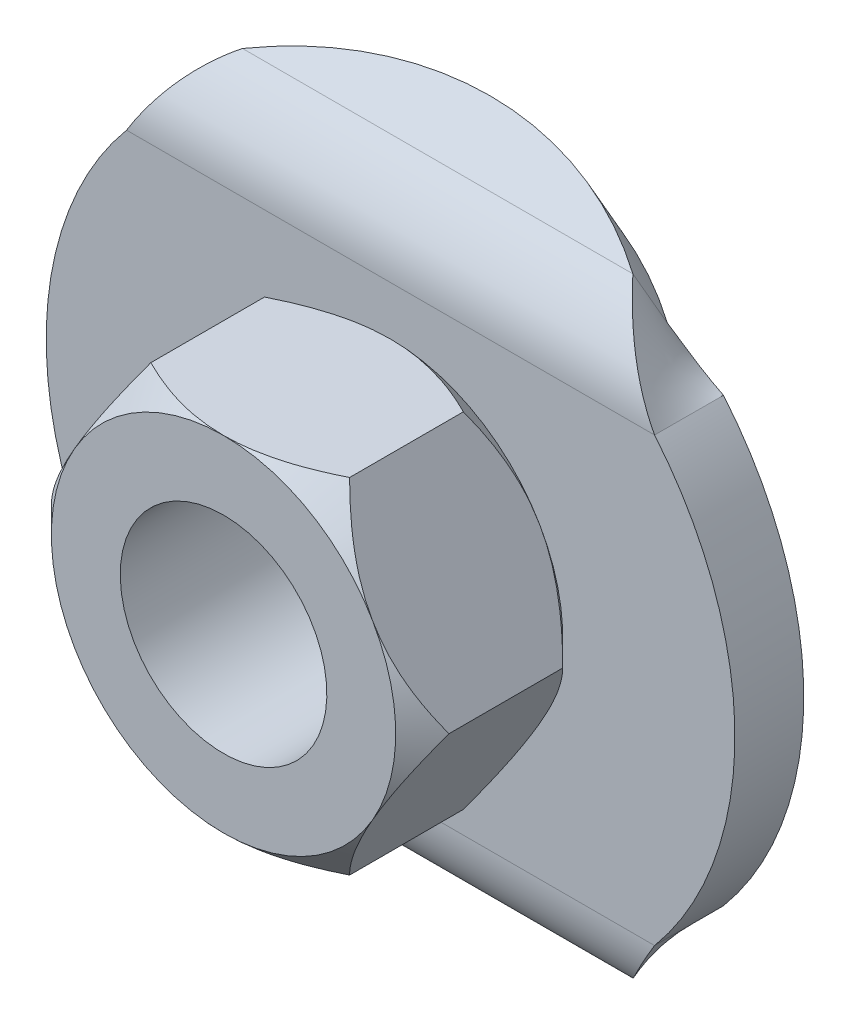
ISO-10303-21;
HEADER;
FILE_DESCRIPTION(('STEP AP214'),'2;1');
FILE_NAME('part.step','',(''),(''),'','','');
FILE_SCHEMA(('AUTOMOTIVE_DESIGN { 1 0 10303 214 1 1 1 1 }'));
ENDSEC;
DATA;
#1=APPLICATION_CONTEXT('core data for automotive mechanical design processes');
#2=APPLICATION_PROTOCOL_DEFINITION('international standard','automotive_design',2000,#1);
#3=PRODUCT_CONTEXT('',#1,'mechanical');
#4=PRODUCT('Part','Part','',(#3));
#5=PRODUCT_RELATED_PRODUCT_CATEGORY('part','',(#4));
#6=PRODUCT_DEFINITION_FORMATION('','',#4);
#7=PRODUCT_DEFINITION_CONTEXT('part definition',#1,'design');
#8=PRODUCT_DEFINITION('design','',#6,#7);
#9=PRODUCT_DEFINITION_SHAPE('','',#8);
#10=(LENGTH_UNIT() NAMED_UNIT(*) SI_UNIT(.MILLI.,.METRE.));
#11=(NAMED_UNIT(*) PLANE_ANGLE_UNIT() SI_UNIT($,.RADIAN.));
#12=(NAMED_UNIT(*) SI_UNIT($,.STERADIAN.) SOLID_ANGLE_UNIT());
#13=UNCERTAINTY_MEASURE_WITH_UNIT(LENGTH_MEASURE(1.E-05),#10,'distance_accuracy_value','');
#14=(GEOMETRIC_REPRESENTATION_CONTEXT(3) GLOBAL_UNCERTAINTY_ASSIGNED_CONTEXT((#13)) GLOBAL_UNIT_ASSIGNED_CONTEXT((#10,
#11,#12)) REPRESENTATION_CONTEXT('',''));
#15=CARTESIAN_POINT('',(0.,0.,0.));
#16=DIRECTION('',(0.,0.,1.));
#17=DIRECTION('',(1.,0.,0.));
#18=AXIS2_PLACEMENT_3D('',#15,#16,#17);
#19=CARTESIAN_POINT('',(0.,0.,0.));
#20=DIRECTION('',(0.,0.,1.));
#21=DIRECTION('',(1.,0.,0.));
#22=AXIS2_PLACEMENT_3D('',#19,#20,#21);
#23=CYLINDRICAL_SURFACE('',#22,3.);
#24=CARTESIAN_POINT('',(0.,0.,0.));
#25=DIRECTION('',(0.,0.,-1.));
#26=DIRECTION('',(-1.,0.,0.));
#27=AXIS2_PLACEMENT_3D('',#24,#25,#26);
#28=CIRCLE('',#27,3.);
#29=CARTESIAN_POINT('',(-3.,0.,0.));
#30=VERTEX_POINT('',#29);
#31=EDGE_CURVE('E938',#30,#30,#28,.T.);
#32=ORIENTED_EDGE('',*,*,#31,.T.);
#33=EDGE_LOOP('',(#32));
#34=FACE_BOUND('',#33,.T.);
#35=CARTESIAN_POINT('',(0.,0.,6.85));
#36=DIRECTION('',(0.,0.,1.));
#37=DIRECTION('',(0.,1.,0.));
#38=AXIS2_PLACEMENT_3D('',#35,#36,#37);
#39=CIRCLE('',#38,3.);
#40=CARTESIAN_POINT('',(0.,3.,6.85));
#41=VERTEX_POINT('',#40);
#42=EDGE_CURVE('E466',#41,#41,#39,.T.);
#43=ORIENTED_EDGE('',*,*,#42,.T.);
#44=EDGE_LOOP('',(#43));
#45=FACE_BOUND('',#44,.T.);
#46=ADVANCED_FACE('F14',(#34,#45),#23,.F.);
#47=CARTESIAN_POINT('',(0.,0.,0.));
#48=DIRECTION('',(0.,0.,1.));
#49=DIRECTION('',(1.,0.,0.));
#50=AXIS2_PLACEMENT_3D('',#47,#48,#49);
#51=CYLINDRICAL_SURFACE('',#50,10.);
#52=CARTESIAN_POINT('',(0.,0.,0.));
#53=DIRECTION('',(0.,0.,-1.));
#54=DIRECTION('',(-1.,0.,0.));
#55=AXIS2_PLACEMENT_3D('',#52,#53,#54);
#56=CIRCLE('',#55,10.);
#57=CARTESIAN_POINT('',(7.6670268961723,6.42002325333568,0.));
#58=VERTEX_POINT('',#57);
#59=CARTESIAN_POINT('',(7.6670268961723,-6.42002325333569,0.));
#60=VERTEX_POINT('',#59);
#61=EDGE_CURVE('E917',#58,#60,#56,.T.);
#62=ORIENTED_EDGE('',*,*,#61,.F.);
#63=CARTESIAN_POINT('',(7.6670268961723,6.42002325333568,0.));
#64=CARTESIAN_POINT('',(7.6670268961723,6.42002325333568,0.666666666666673));
#65=CARTESIAN_POINT('',(7.6670268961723,6.42002325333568,1.33333333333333));
#66=CARTESIAN_POINT('',(7.6670268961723,6.42002325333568,2.));
#67=(BOUNDED_CURVE() B_SPLINE_CURVE(3,(#63,#64,#65,#66),.UNSPECIFIED.,.F.,
.F.) B_SPLINE_CURVE_WITH_KNOTS((4,4),(0.,1.),
.UNSPECIFIED.) CURVE() GEOMETRIC_REPRESENTATION_ITEM() RATIONAL_B_SPLINE_CURVE((1.,1.,1.,1.)) REPRESENTATION_ITEM(''));
#68=CARTESIAN_POINT('',(7.6670268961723,6.42002325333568,2.));
#69=VERTEX_POINT('',#68);
#70=EDGE_CURVE('E986',#58,#69,#67,.T.);
#71=ORIENTED_EDGE('',*,*,#70,.T.);
#72=CARTESIAN_POINT('',(0.,0.,2.));
#73=DIRECTION('',(0.,0.,-1.));
#74=DIRECTION('',(-1.,0.,0.));
#75=AXIS2_PLACEMENT_3D('',#72,#73,#74);
#76=CIRCLE('',#75,10.);
#77=CARTESIAN_POINT('',(7.6670268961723,-6.42002325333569,2.));
#78=VERTEX_POINT('',#77);
#79=EDGE_CURVE('E930',#69,#78,#76,.T.);
#80=ORIENTED_EDGE('',*,*,#79,.T.);
#81=CARTESIAN_POINT('',(7.6670268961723,-6.42002325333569,2.));
#82=CARTESIAN_POINT('',(7.6670268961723,-6.42002325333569,1.33333333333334));
#83=CARTESIAN_POINT('',(7.6670268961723,-6.42002325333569,0.666666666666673));
#84=CARTESIAN_POINT('',(7.6670268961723,-6.42002325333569,0.));
#85=(BOUNDED_CURVE() B_SPLINE_CURVE(3,(#81,#82,#83,#84),.UNSPECIFIED.,.F.,
.F.) B_SPLINE_CURVE_WITH_KNOTS((4,4),(0.,1.),
.UNSPECIFIED.) CURVE() GEOMETRIC_REPRESENTATION_ITEM() RATIONAL_B_SPLINE_CURVE((1.,1.,1.,1.)) REPRESENTATION_ITEM(''));
#86=EDGE_CURVE('E926',#78,#60,#85,.T.);
#87=ORIENTED_EDGE('',*,*,#86,.T.);
#88=EDGE_LOOP('',(#62,#71,#80,#87));
#89=FACE_BOUND('',#88,.T.);
#90=ADVANCED_FACE('F781',(#89),#51,.T.);
#91=CARTESIAN_POINT('',(0.,0.,2.));
#92=DIRECTION('',(0.,0.,-1.));
#93=DIRECTION('',(-1.,0.,0.));
#94=AXIS2_PLACEMENT_3D('',#91,#92,#93);
#95=PLANE('',#94);
#96=CARTESIAN_POINT('',(0.,0.,2.));
#97=DIRECTION('',(0.,0.,-1.));
#98=DIRECTION('',(1.,0.,0.));
#99=AXIS2_PLACEMENT_3D('',#96,#97,#98);
#100=CIRCLE('',#99,5.);
#101=CARTESIAN_POINT('',(-4.3301270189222,-2.5,2.));
#102=VERTEX_POINT('',#101);
#103=CARTESIAN_POINT('',(-4.3301270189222,2.5,2.));
#104=VERTEX_POINT('',#103);
#105=EDGE_CURVE('E28',#102,#104,#100,.T.);
#106=ORIENTED_EDGE('',*,*,#105,.T.);
#107=CARTESIAN_POINT('',(0.,0.,2.));
#108=DIRECTION('',(0.,0.,-1.));
#109=DIRECTION('',(1.,0.,0.));
#110=AXIS2_PLACEMENT_3D('',#107,#108,#109);
#111=CIRCLE('',#110,5.);
#112=CARTESIAN_POINT('',(0.,5.,2.));
#113=VERTEX_POINT('',#112);
#114=EDGE_CURVE('E9',#104,#113,#111,.T.);
#115=ORIENTED_EDGE('',*,*,#114,.T.);
#116=CARTESIAN_POINT('',(0.,0.,2.));
#117=DIRECTION('',(0.,0.,-1.));
#118=DIRECTION('',(1.,0.,0.));
#119=AXIS2_PLACEMENT_3D('',#116,#117,#118);
#120=CIRCLE('',#119,5.);
#121=CARTESIAN_POINT('',(4.3301270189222,2.5,2.));
#122=VERTEX_POINT('',#121);
#123=EDGE_CURVE('E967',#113,#122,#120,.T.);
#124=ORIENTED_EDGE('',*,*,#123,.T.);
#125=CARTESIAN_POINT('',(0.,0.,2.));
#126=DIRECTION('',(0.,0.,-1.));
#127=DIRECTION('',(1.,0.,0.));
#128=AXIS2_PLACEMENT_3D('',#125,#126,#127);
#129=CIRCLE('',#128,5.);
#130=CARTESIAN_POINT('',(4.3301270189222,-2.5,2.));
#131=VERTEX_POINT('',#130);
#132=EDGE_CURVE('E1297',#122,#131,#129,.T.);
#133=ORIENTED_EDGE('',*,*,#132,.T.);
#134=CARTESIAN_POINT('',(0.,0.,2.));
#135=DIRECTION('',(0.,0.,-1.));
#136=DIRECTION('',(1.,0.,0.));
#137=AXIS2_PLACEMENT_3D('',#134,#135,#136);
#138=CIRCLE('',#137,5.);
#139=CARTESIAN_POINT('',(0.,-5.,2.));
#140=VERTEX_POINT('',#139);
#141=EDGE_CURVE('E1303',#131,#140,#138,.T.);
#142=ORIENTED_EDGE('',*,*,#141,.T.);
#143=CARTESIAN_POINT('',(0.,0.,2.));
#144=DIRECTION('',(0.,0.,-1.));
#145=DIRECTION('',(1.,0.,0.));
#146=AXIS2_PLACEMENT_3D('',#143,#144,#145);
#147=CIRCLE('',#146,5.);
#148=EDGE_CURVE('E1309',#140,#102,#147,.T.);
#149=ORIENTED_EDGE('',*,*,#148,.T.);
#150=EDGE_LOOP('',(#106,#115,#124,#133,#142,#149));
#151=FACE_BOUND('',#150,.T.);
#152=CARTESIAN_POINT('',(0.,0.,2.));
#153=DIRECTION('',(0.,0.,-1.));
#154=DIRECTION('',(-1.,0.,0.));
#155=AXIS2_PLACEMENT_3D('',#152,#153,#154);
#156=CIRCLE('',#155,10.);
#157=CARTESIAN_POINT('',(-7.6670268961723,-6.42002325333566,2.));
#158=VERTEX_POINT('',#157);
#159=CARTESIAN_POINT('',(-7.6670268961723,6.42002325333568,2.));
#160=VERTEX_POINT('',#159);
#161=EDGE_CURVE('E945',#158,#160,#156,.T.);
#162=ORIENTED_EDGE('',*,*,#161,.F.);
#163=DIRECTION('',(1.,0.,0.));
#164=VECTOR('',#163,1.);
#165=CARTESIAN_POINT('',(0.,-6.42002325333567,2.));
#166=LINE('',#165,#164);
#167=EDGE_CURVE('E912',#158,#78,#166,.T.);
#168=ORIENTED_EDGE('',*,*,#167,.T.);
#169=ORIENTED_EDGE('',*,*,#79,.F.);
#170=DIRECTION('',(-1.,0.,0.));
#171=VECTOR('',#170,1.);
#172=CARTESIAN_POINT('',(0.,6.42002325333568,2.));
#173=LINE('',#172,#171);
#174=EDGE_CURVE('E908',#69,#160,#173,.T.);
#175=ORIENTED_EDGE('',*,*,#174,.T.);
#176=EDGE_LOOP('',(#162,#168,#169,#175));
#177=FACE_BOUND('',#176,.T.);
#178=ADVANCED_FACE('F776',(#151,#177),#95,.F.);
#179=CARTESIAN_POINT('',(0.,0.,0.));
#180=DIRECTION('',(0.,0.,1.));
#181=DIRECTION('',(1.,0.,0.));
#182=AXIS2_PLACEMENT_3D('',#179,#180,#181);
#183=CYLINDRICAL_SURFACE('',#182,10.);
#184=CARTESIAN_POINT('',(0.,0.,0.));
#185=DIRECTION('',(0.,0.,-1.));
#186=DIRECTION('',(-1.,0.,0.));
#187=AXIS2_PLACEMENT_3D('',#184,#185,#186);
#188=CIRCLE('',#187,10.);
#189=CARTESIAN_POINT('',(-7.6670268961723,-6.42002325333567,0.));
#190=VERTEX_POINT('',#189);
#191=CARTESIAN_POINT('',(-7.6670268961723,6.42002325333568,0.));
#192=VERTEX_POINT('',#191);
#193=EDGE_CURVE('E922',#190,#192,#188,.T.);
#194=ORIENTED_EDGE('',*,*,#193,.F.);
#195=CARTESIAN_POINT('',(-7.6670268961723,-6.42002325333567,0.));
#196=CARTESIAN_POINT('',(-7.6670268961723,-6.42002325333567,0.666666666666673));
#197=CARTESIAN_POINT('',(-7.6670268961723,-6.42002325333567,1.33333333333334));
#198=CARTESIAN_POINT('',(-7.6670268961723,-6.42002325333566,2.));
#199=(BOUNDED_CURVE() B_SPLINE_CURVE(3,(#195,#196,#197,#198),.UNSPECIFIED.,.F.,
.F.) B_SPLINE_CURVE_WITH_KNOTS((4,4),(0.,1.),
.UNSPECIFIED.) CURVE() GEOMETRIC_REPRESENTATION_ITEM() RATIONAL_B_SPLINE_CURVE((1.,1.,1.,1.)) REPRESENTATION_ITEM(''));
#200=EDGE_CURVE('E913',#190,#158,#199,.T.);
#201=ORIENTED_EDGE('',*,*,#200,.T.);
#202=ORIENTED_EDGE('',*,*,#161,.T.);
#203=CARTESIAN_POINT('',(-7.6670268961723,6.42002325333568,2.));
#204=CARTESIAN_POINT('',(-7.6670268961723,6.42002325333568,1.33333333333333));
#205=CARTESIAN_POINT('',(-7.6670268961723,6.42002325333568,0.666666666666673));
#206=CARTESIAN_POINT('',(-7.6670268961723,6.42002325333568,0.));
#207=(BOUNDED_CURVE() B_SPLINE_CURVE(3,(#203,#204,#205,#206),.UNSPECIFIED.,.F.,
.F.) B_SPLINE_CURVE_WITH_KNOTS((4,4),(0.,1.),
.UNSPECIFIED.) CURVE() GEOMETRIC_REPRESENTATION_ITEM() RATIONAL_B_SPLINE_CURVE((1.,1.,1.,1.)) REPRESENTATION_ITEM(''));
#208=EDGE_CURVE('E982',#160,#192,#207,.T.);
#209=ORIENTED_EDGE('',*,*,#208,.T.);
#210=EDGE_LOOP('',(#194,#201,#202,#209));
#211=FACE_BOUND('',#210,.T.);
#212=ADVANCED_FACE('F780',(#211),#183,.T.);
#213=CARTESIAN_POINT('',(0.,0.,0.));
#214=DIRECTION('',(0.,0.,-1.));
#215=DIRECTION('',(-1.,0.,0.));
#216=AXIS2_PLACEMENT_3D('',#213,#214,#215);
#217=PLANE('',#216);
#218=DIRECTION('',(1.,0.,0.));
#219=VECTOR('',#218,1.);
#220=CARTESIAN_POINT('',(0.,-6.42002325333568,0.));
#221=LINE('',#220,#219);
#222=EDGE_CURVE('E904',#190,#60,#221,.T.);
#223=ORIENTED_EDGE('',*,*,#222,.F.);
#224=ORIENTED_EDGE('',*,*,#193,.T.);
#225=DIRECTION('',(-1.,0.,0.));
#226=VECTOR('',#225,1.);
#227=CARTESIAN_POINT('',(0.,6.42002325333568,0.));
#228=LINE('',#227,#226);
#229=EDGE_CURVE('E975',#58,#192,#228,.T.);
#230=ORIENTED_EDGE('',*,*,#229,.F.);
#231=ORIENTED_EDGE('',*,*,#61,.T.);
#232=EDGE_LOOP('',(#223,#224,#230,#231));
#233=FACE_BOUND('',#232,.T.);
#234=ORIENTED_EDGE('',*,*,#31,.F.);
#235=EDGE_LOOP('',(#234));
#236=FACE_BOUND('',#235,.T.);
#237=ADVANCED_FACE('F770',(#233,#236),#217,.T.);
#238=CARTESIAN_POINT('',(5.6679530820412,8.78998837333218,0.6317));
#239=CARTESIAN_POINT('',(5.8968119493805,8.64591131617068,0.881248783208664));
#240=CARTESIAN_POINT('',(6.1099145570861,8.46888939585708,1.09657074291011));
#241=CARTESIAN_POINT('',(6.505254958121,8.08160135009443,1.45372547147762));
#242=CARTESIAN_POINT('',(6.6873848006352,7.87151274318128,1.59560703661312));
#243=CARTESIAN_POINT('',(7.187153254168,7.23264644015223,1.9198544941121));
#244=CARTESIAN_POINT('',(7.4589819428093,6.79776767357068,2.));
#245=CARTESIAN_POINT('',(7.6670268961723,6.42002325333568,2.));
#246=CARTESIAN_POINT('',(5.6679530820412,7.05793756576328,-0.368300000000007));
#247=CARTESIAN_POINT('',(5.8967221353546,7.01917212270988,-0.301156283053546));
#248=CARTESIAN_POINT('',(6.1099145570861,6.97150860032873,-0.243172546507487));
#249=CARTESIAN_POINT('',(6.505254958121,6.86726378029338,-0.147038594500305));
#250=CARTESIAN_POINT('',(6.6873848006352,6.81071504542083,-0.108848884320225));
#251=CARTESIAN_POINT('',(7.187153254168,6.63875388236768,-0.0215724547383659));
#252=CARTESIAN_POINT('',(7.45837461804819,6.52199606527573,0.));
#253=CARTESIAN_POINT('',(7.6670268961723,6.42002325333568,0.));
#254=(BOUNDED_SURFACE() B_SPLINE_SURFACE(1,3,((#238,#239,#240,#241,#242,#243,#244,#245),(#246,
#247,#248,#249,#250,#251,#252,#253)),.UNSPECIFIED.,.F.,.F.,.F.) B_SPLINE_SURFACE_WITH_KNOTS((2,
2),(4,2,2,4),(0.,1.),(0.,0.25,0.5,1.),
.UNSPECIFIED.) GEOMETRIC_REPRESENTATION_ITEM() RATIONAL_B_SPLINE_SURFACE(((1.,1.,1.,1.,1.,1.,1.,
1.),(1.,1.,1.,1.,1.,1.,1.,1.))) REPRESENTATION_ITEM('') SURFACE());
#255=CARTESIAN_POINT('',(5.6679530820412,7.05793756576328,-0.368300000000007));
#256=CARTESIAN_POINT('',(5.6679530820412,8.78998837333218,0.6317));
#257=(BOUNDED_CURVE() B_SPLINE_CURVE(1,(#255,#256),.UNSPECIFIED.,.F.,
.F.) B_SPLINE_CURVE_WITH_KNOTS((2,2),(0.,1.),
.UNSPECIFIED.) CURVE() GEOMETRIC_REPRESENTATION_ITEM() RATIONAL_B_SPLINE_CURVE((1.,1.)) REPRESENTATION_ITEM(''));
#258=CARTESIAN_POINT('',(5.6679530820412,7.05793756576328,-0.368300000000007));
#259=VERTEX_POINT('',#258);
#260=CARTESIAN_POINT('',(5.6679530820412,8.78998837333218,0.6317));
#261=VERTEX_POINT('',#260);
#262=EDGE_CURVE('E896',#259,#261,#257,.T.);
#263=CARTESIAN_POINT('',(5.6679530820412,8.78998837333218,0.6317));
#264=CARTESIAN_POINT('',(5.8968119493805,8.64591131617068,0.881248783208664));
#265=CARTESIAN_POINT('',(6.1099145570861,8.46888939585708,1.09657074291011));
#266=CARTESIAN_POINT('',(6.505254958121,8.08160135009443,1.45372547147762));
#267=CARTESIAN_POINT('',(6.6873848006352,7.87151274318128,1.59560703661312));
#268=CARTESIAN_POINT('',(7.187153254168,7.23264644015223,1.9198544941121));
#269=CARTESIAN_POINT('',(7.4589819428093,6.79776767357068,2.));
#270=CARTESIAN_POINT('',(7.6670268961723,6.42002325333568,2.));
#271=(BOUNDED_CURVE() B_SPLINE_CURVE(3,(#263,#264,#265,#266,#267,#268,#269,#270),.UNSPECIFIED.,
.F.,.F.) B_SPLINE_CURVE_WITH_KNOTS((4,2,2,4),(0.,0.25,0.5,1.),
.UNSPECIFIED.) CURVE() GEOMETRIC_REPRESENTATION_ITEM() RATIONAL_B_SPLINE_CURVE((1.,1.,1.,1.,1.,
1.,1.,1.)) REPRESENTATION_ITEM(''));
#272=EDGE_CURVE('E892',#261,#69,#271,.T.);
#273=CARTESIAN_POINT('',(7.6670268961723,6.42002325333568,0.));
#274=CARTESIAN_POINT('',(7.45837461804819,6.52199606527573,0.));
#275=CARTESIAN_POINT('',(7.187153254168,6.63875388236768,-0.0215724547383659));
#276=CARTESIAN_POINT('',(6.6873848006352,6.81071504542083,-0.108848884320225));
#277=CARTESIAN_POINT('',(6.505254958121,6.86726378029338,-0.147038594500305));
#278=CARTESIAN_POINT('',(6.1099145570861,6.97150860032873,-0.243172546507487));
#279=CARTESIAN_POINT('',(5.8967221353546,7.01917212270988,-0.301156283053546));
#280=CARTESIAN_POINT('',(5.6679530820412,7.05793756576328,-0.368300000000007));
#281=(BOUNDED_CURVE() B_SPLINE_CURVE(3,(#273,#274,#275,#276,#277,#278,#279,#280),.UNSPECIFIED.,
.F.,.F.) B_SPLINE_CURVE_WITH_KNOTS((4,2,2,4),(0.,0.5,0.75,1.),
.UNSPECIFIED.) CURVE() GEOMETRIC_REPRESENTATION_ITEM() RATIONAL_B_SPLINE_CURVE((1.,1.,1.,1.,1.,
1.,1.,1.)) REPRESENTATION_ITEM(''));
#282=EDGE_CURVE('E976',#259,#58,#281,.F.);
#283=ORIENTED_EDGE('',*,*,#262,.T.);
#284=ORIENTED_EDGE('',*,*,#272,.T.);
#285=ORIENTED_EDGE('',*,*,#70,.F.);
#286=ORIENTED_EDGE('',*,*,#282,.F.);
#287=EDGE_LOOP('',(#283,#284,#285,#286));
#288=FACE_BOUND('',#287,.T.);
#289=ADVANCED_FACE('F766',(#288),#254,.F.);
#290=CARTESIAN_POINT('',(-7.6670268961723,6.42002325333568,2.));
#291=CARTESIAN_POINT('',(-7.4716069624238,6.73907104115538,2.));
#292=CARTESIAN_POINT('',(-7.28371471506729,7.03641836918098,1.94421249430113));
#293=CARTESIAN_POINT('',(-6.9218881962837,7.56434233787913,1.76484606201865));
#294=CARTESIAN_POINT('',(-6.7481368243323,7.79491188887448,1.64157001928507));
#295=CARTESIAN_POINT('',(-6.4149578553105,8.18606133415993,1.36747245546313));
#296=CARTESIAN_POINT('',(-6.25553025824,8.34693227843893,1.21674090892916));
#297=CARTESIAN_POINT('',(-5.9509988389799,8.60906673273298,0.917669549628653));
#298=CARTESIAN_POINT('',(-5.8058215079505,8.71059189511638,0.769218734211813));
#299=CARTESIAN_POINT('',(-5.6679530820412,8.78998837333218,0.6317));
#300=CARTESIAN_POINT('',(-7.6670268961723,6.42002325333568,0.));
#301=CARTESIAN_POINT('',(-7.4717491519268,6.50583762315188,0.));
#302=CARTESIAN_POINT('',(-7.28371471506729,6.58593593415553,-0.0150161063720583));
#303=CARTESIAN_POINT('',(-6.9218881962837,6.72803517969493,-0.063295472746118));
#304=CARTESIAN_POINT('',(-6.7481368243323,6.79009669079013,-0.0964772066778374));
#305=CARTESIAN_POINT('',(-6.4149578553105,6.89538086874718,-0.170254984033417));
#306=CARTESIAN_POINT('',(-6.25553025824,6.93868187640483,-0.210826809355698));
#307=CARTESIAN_POINT('',(-5.9509988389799,7.00923959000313,-0.291326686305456));
#308=CARTESIAN_POINT('',(-5.80588371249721,7.03655708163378,-0.331267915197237));
#309=CARTESIAN_POINT('',(-5.6679530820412,7.05793756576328,-0.3683));
#310=(BOUNDED_SURFACE() B_SPLINE_SURFACE(1,3,((#290,#291,#292,#293,#294,#295,#296,#297,#298,
#299),(#300,#301,#302,#303,#304,#305,#306,#307,#308,#309)),.UNSPECIFIED.,.F.,.F.,
.F.) B_SPLINE_SURFACE_WITH_KNOTS((2,2),(4,2,2,2,4),(0.,1.),(0.,0.25,0.5,0.75,1.),
.UNSPECIFIED.) GEOMETRIC_REPRESENTATION_ITEM() RATIONAL_B_SPLINE_SURFACE(((1.,1.,1.,1.,1.,1.,1.,
1.,1.,1.),(1.,1.,1.,1.,1.,1.,1.,1.,1.,1.))) REPRESENTATION_ITEM('') SURFACE());
#311=CARTESIAN_POINT('',(-7.6670268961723,6.42002325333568,2.));
#312=CARTESIAN_POINT('',(-7.4716069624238,6.73907104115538,2.));
#313=CARTESIAN_POINT('',(-7.28371471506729,7.03641836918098,1.94421249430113));
#314=CARTESIAN_POINT('',(-6.9218881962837,7.56434233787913,1.76484606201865));
#315=CARTESIAN_POINT('',(-6.7481368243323,7.79491188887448,1.64157001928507));
#316=CARTESIAN_POINT('',(-6.4149578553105,8.18606133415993,1.36747245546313));
#317=CARTESIAN_POINT('',(-6.25553025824,8.34693227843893,1.21674090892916));
#318=CARTESIAN_POINT('',(-5.9509988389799,8.60906673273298,0.917669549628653));
#319=CARTESIAN_POINT('',(-5.8058215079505,8.71059189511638,0.769218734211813));
#320=CARTESIAN_POINT('',(-5.6679530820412,8.78998837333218,0.6317));
#321=(BOUNDED_CURVE() B_SPLINE_CURVE(3,(#311,#312,#313,#314,#315,#316,#317,#318,#319,#320),
.UNSPECIFIED.,.F.,.F.) B_SPLINE_CURVE_WITH_KNOTS((4,2,2,2,4),(0.,0.25,0.5,0.75,1.),
.UNSPECIFIED.) CURVE() GEOMETRIC_REPRESENTATION_ITEM() RATIONAL_B_SPLINE_CURVE((1.,1.,1.,1.,1.,
1.,1.,1.,1.,1.)) REPRESENTATION_ITEM(''));
#322=CARTESIAN_POINT('',(-5.6679530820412,8.78998837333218,0.6317));
#323=VERTEX_POINT('',#322);
#324=EDGE_CURVE('E897',#160,#323,#321,.T.);
#325=CARTESIAN_POINT('',(-5.6679530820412,8.78998837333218,0.6317));
#326=CARTESIAN_POINT('',(-5.6679530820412,7.05793756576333,-0.3683));
#327=(BOUNDED_CURVE() B_SPLINE_CURVE(1,(#325,#326),.UNSPECIFIED.,.F.,
.F.) B_SPLINE_CURVE_WITH_KNOTS((2,2),(0.,1.),
.UNSPECIFIED.) CURVE() GEOMETRIC_REPRESENTATION_ITEM() RATIONAL_B_SPLINE_CURVE((1.,1.)) REPRESENTATION_ITEM(''));
#328=CARTESIAN_POINT('',(-5.6679530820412,7.05793756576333,-0.3683));
#329=VERTEX_POINT('',#328);
#330=EDGE_CURVE('E993',#323,#329,#327,.T.);
#331=CARTESIAN_POINT('',(-5.6679530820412,7.05793756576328,-0.3683));
#332=CARTESIAN_POINT('',(-5.80588371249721,7.03655708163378,-0.331267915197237));
#333=CARTESIAN_POINT('',(-5.9509988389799,7.00923959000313,-0.291326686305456));
#334=CARTESIAN_POINT('',(-6.25553025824,6.93868187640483,-0.210826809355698));
#335=CARTESIAN_POINT('',(-6.4149578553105,6.89538086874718,-0.170254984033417));
#336=CARTESIAN_POINT('',(-6.7481368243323,6.79009669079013,-0.0964772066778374));
#337=CARTESIAN_POINT('',(-6.9218881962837,6.72803517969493,-0.063295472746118));
#338=CARTESIAN_POINT('',(-7.28371471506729,6.58593593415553,-0.0150161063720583));
#339=CARTESIAN_POINT('',(-7.4717491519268,6.50583762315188,0.));
#340=CARTESIAN_POINT('',(-7.6670268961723,6.42002325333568,0.));
#341=(BOUNDED_CURVE() B_SPLINE_CURVE(3,(#331,#332,#333,#334,#335,#336,#337,#338,#339,#340),
.UNSPECIFIED.,.F.,.F.) B_SPLINE_CURVE_WITH_KNOTS((4,2,2,2,4),(0.,0.25,0.5,0.75,1.),
.UNSPECIFIED.) CURVE() GEOMETRIC_REPRESENTATION_ITEM() RATIONAL_B_SPLINE_CURVE((1.,1.,1.,1.,1.,
1.,1.,1.,1.,1.)) REPRESENTATION_ITEM(''));
#342=EDGE_CURVE('E971',#192,#329,#341,.F.);
#343=ORIENTED_EDGE('',*,*,#324,.T.);
#344=ORIENTED_EDGE('',*,*,#330,.T.);
#345=ORIENTED_EDGE('',*,*,#342,.F.);
#346=ORIENTED_EDGE('',*,*,#208,.F.);
#347=EDGE_LOOP('',(#343,#344,#345,#346));
#348=FACE_BOUND('',#347,.T.);
#349=ADVANCED_FACE('F729',(#348),#310,.F.);
#350=CARTESIAN_POINT('',(-15.5704970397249,6.42002325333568,-0.736599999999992));
#351=DIRECTION('',(1.,0.,0.));
#352=DIRECTION('',(0.,0.,-1.));
#353=AXIS2_PLACEMENT_3D('',#350,#351,#352);
#354=CYLINDRICAL_SURFACE('',#353,0.7366);
#355=ORIENTED_EDGE('',*,*,#229,.T.);
#356=ORIENTED_EDGE('',*,*,#342,.T.);
#357=DIRECTION('',(-1.,0.,0.));
#358=VECTOR('',#357,1.);
#359=CARTESIAN_POINT('',(0.,7.05793756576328,-0.3683));
#360=LINE('',#359,#358);
#361=EDGE_CURVE('E1006',#259,#329,#360,.T.);
#362=ORIENTED_EDGE('',*,*,#361,.F.);
#363=ORIENTED_EDGE('',*,*,#282,.T.);
#364=EDGE_LOOP('',(#355,#356,#362,#363));
#365=FACE_BOUND('',#364,.T.);
#366=ADVANCED_FACE('F724',(#365),#354,.F.);
#367=CARTESIAN_POINT('',(-15.5704970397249,6.42002325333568,-0.736599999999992));
#368=DIRECTION('',(1.,0.,0.));
#369=DIRECTION('',(0.,0.,-1.));
#370=AXIS2_PLACEMENT_3D('',#367,#368,#369);
#371=CYLINDRICAL_SURFACE('',#370,2.7366);
#372=ORIENTED_EDGE('',*,*,#174,.F.);
#373=ORIENTED_EDGE('',*,*,#272,.F.);
#374=DIRECTION('',(-1.,0.,0.));
#375=VECTOR('',#374,1.);
#376=CARTESIAN_POINT('',(0.,8.78998837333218,0.63169999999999));
#377=LINE('',#376,#375);
#378=EDGE_CURVE('E1003',#261,#323,#377,.T.);
#379=ORIENTED_EDGE('',*,*,#378,.T.);
#380=ORIENTED_EDGE('',*,*,#324,.F.);
#381=EDGE_LOOP('',(#372,#373,#379,#380));
#382=FACE_BOUND('',#381,.T.);
#383=ADVANCED_FACE('F728',(#382),#371,.T.);
#384=CARTESIAN_POINT('',(0.,2.93864430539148,6.76652521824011));
#385=DIRECTION('',(0.,-0.86602540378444,-0.5));
#386=DIRECTION('',(1.,0.,0.));
#387=AXIS2_PLACEMENT_3D('',#384,#385,#386);
#388=PLANE('',#387);
#389=CARTESIAN_POINT('',(0.,2.93864430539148,6.76652521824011));
#390=DIRECTION('',(0.,-0.86602540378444,-0.5));
#391=DIRECTION('',(-1.,0.,0.));
#392=AXIS2_PLACEMENT_3D('',#389,#390,#391);
#393=CIRCLE('',#392,10.);
#394=EDGE_CURVE('E1009',#329,#259,#393,.T.);
#395=ORIENTED_EDGE('',*,*,#394,.T.);
#396=ORIENTED_EDGE('',*,*,#361,.T.);
#397=EDGE_LOOP('',(#395,#396));
#398=FACE_BOUND('',#397,.T.);
#399=ADVANCED_FACE('F749',(#398),#388,.T.);
#400=CARTESIAN_POINT('',(0.,2.93864430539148,6.76652521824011));
#401=DIRECTION('',(0.,0.86602540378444,0.5));
#402=DIRECTION('',(1.,0.,0.));
#403=AXIS2_PLACEMENT_3D('',#400,#401,#402);
#404=CYLINDRICAL_SURFACE('',#403,10.);
#405=ORIENTED_EDGE('',*,*,#262,.F.);
#406=ORIENTED_EDGE('',*,*,#394,.F.);
#407=ORIENTED_EDGE('',*,*,#330,.F.);
#408=CARTESIAN_POINT('',(0.,4.67069511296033,7.76652521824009));
#409=DIRECTION('',(0.,-0.86602540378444,-0.5));
#410=DIRECTION('',(-1.,0.,0.));
#411=AXIS2_PLACEMENT_3D('',#408,#409,#410);
#412=CIRCLE('',#411,10.);
#413=EDGE_CURVE('E1010',#323,#261,#412,.T.);
#414=ORIENTED_EDGE('',*,*,#413,.T.);
#415=EDGE_LOOP('',(#405,#406,#407,#414));
#416=FACE_BOUND('',#415,.T.);
#417=ADVANCED_FACE('F744',(#416),#404,.T.);
#418=CARTESIAN_POINT('',(0.,4.67069511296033,7.76652521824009));
#419=DIRECTION('',(0.,-0.86602540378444,-0.5));
#420=DIRECTION('',(1.,0.,0.));
#421=AXIS2_PLACEMENT_3D('',#418,#419,#420);
#422=PLANE('',#421);
#423=ORIENTED_EDGE('',*,*,#378,.F.);
#424=ORIENTED_EDGE('',*,*,#413,.F.);
#425=EDGE_LOOP('',(#423,#424));
#426=FACE_BOUND('',#425,.T.);
#427=ADVANCED_FACE('F748',(#426),#422,.F.);
#428=CARTESIAN_POINT('',(-5.6679530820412,-8.78998837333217,0.631700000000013));
#429=CARTESIAN_POINT('',(-5.8968073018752,-8.64591424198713,0.881243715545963));
#430=CARTESIAN_POINT('',(-6.1099064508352,-8.46889604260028,1.09656289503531));
#431=CARTESIAN_POINT('',(-6.5052422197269,-8.08161399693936,1.45371552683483));
#432=CARTESIAN_POINT('',(-6.6873709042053,-7.87152765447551,1.59559775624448));
#433=CARTESIAN_POINT('',(-7.187139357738,-7.23266342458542,1.91984929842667));
#434=CARTESIAN_POINT('',(-7.4589725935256,-6.79777951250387,2.));
#435=CARTESIAN_POINT('',(-7.6670268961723,-6.42002325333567,2.));
#436=CARTESIAN_POINT('',(-5.6679530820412,-7.05793756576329,-0.3683));
#437=CARTESIAN_POINT('',(-5.8967175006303,-7.01917290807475,-0.301157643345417));
#438=CARTESIAN_POINT('',(-6.1099064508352,-6.97151038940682,-0.243174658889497));
#439=CARTESIAN_POINT('',(-6.5052422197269,-6.86726718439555,-0.147041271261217));
#440=CARTESIAN_POINT('',(-6.6873709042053,-6.81071905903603,-0.108851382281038));
#441=CARTESIAN_POINT('',(-7.187139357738,-6.63875845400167,-0.0215738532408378));
#442=CARTESIAN_POINT('',(-7.45836532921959,-6.52199921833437,0.));
#443=CARTESIAN_POINT('',(-7.6670268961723,-6.42002325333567,0.));
#444=(BOUNDED_SURFACE() B_SPLINE_SURFACE(1,3,((#428,#429,#430,#431,#432,#433,#434,#435),(#436,
#437,#438,#439,#440,#441,#442,#443)),.UNSPECIFIED.,.F.,.F.,.F.) B_SPLINE_SURFACE_WITH_KNOTS((2,
2),(4,2,2,4),(0.,1.),(0.,0.25,0.5,1.),
.UNSPECIFIED.) GEOMETRIC_REPRESENTATION_ITEM() RATIONAL_B_SPLINE_SURFACE(((1.,1.,1.,1.,1.,1.,1.,
1.),(1.,1.,1.,1.,1.,1.,1.,1.))) REPRESENTATION_ITEM('') SURFACE());
#445=CARTESIAN_POINT('',(-5.6679530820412,-7.05793756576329,-0.3683));
#446=CARTESIAN_POINT('',(-5.6679530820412,-8.78998837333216,0.631700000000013));
#447=(BOUNDED_CURVE() B_SPLINE_CURVE(1,(#445,#446),.UNSPECIFIED.,.F.,
.F.) B_SPLINE_CURVE_WITH_KNOTS((2,2),(0.,1.),
.UNSPECIFIED.) CURVE() GEOMETRIC_REPRESENTATION_ITEM() RATIONAL_B_SPLINE_CURVE((1.,1.)) REPRESENTATION_ITEM(''));
#448=CARTESIAN_POINT('',(-5.6679530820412,-7.05793756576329,-0.3683));
#449=VERTEX_POINT('',#448);
#450=CARTESIAN_POINT('',(-5.6679530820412,-8.78998837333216,0.631700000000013));
#451=VERTEX_POINT('',#450);
#452=EDGE_CURVE('E1022',#449,#451,#447,.T.);
#453=CARTESIAN_POINT('',(-5.6679530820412,-8.78998837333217,0.631700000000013));
#454=CARTESIAN_POINT('',(-5.8968073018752,-8.64591424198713,0.881243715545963));
#455=CARTESIAN_POINT('',(-6.1099064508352,-8.46889604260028,1.09656289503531));
#456=CARTESIAN_POINT('',(-6.5052422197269,-8.08161399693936,1.45371552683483));
#457=CARTESIAN_POINT('',(-6.6873709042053,-7.87152765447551,1.59559775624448));
#458=CARTESIAN_POINT('',(-7.187139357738,-7.23266342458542,1.91984929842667));
#459=CARTESIAN_POINT('',(-7.4589725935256,-6.79777951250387,2.));
#460=CARTESIAN_POINT('',(-7.6670268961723,-6.42002325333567,2.));
#461=(BOUNDED_CURVE() B_SPLINE_CURVE(3,(#453,#454,#455,#456,#457,#458,#459,#460),.UNSPECIFIED.,
.F.,.F.) B_SPLINE_CURVE_WITH_KNOTS((4,2,2,4),(0.,0.25,0.5,1.),
.UNSPECIFIED.) CURVE() GEOMETRIC_REPRESENTATION_ITEM() RATIONAL_B_SPLINE_CURVE((1.,1.,1.,1.,1.,
1.,1.,1.)) REPRESENTATION_ITEM(''));
#462=EDGE_CURVE('E1050',#451,#158,#461,.T.);
#463=CARTESIAN_POINT('',(-7.6670268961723,-6.42002325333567,0.));
#464=CARTESIAN_POINT('',(-7.45836532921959,-6.52199921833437,0.));
#465=CARTESIAN_POINT('',(-7.187139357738,-6.63875845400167,-0.0215738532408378));
#466=CARTESIAN_POINT('',(-6.6873709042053,-6.81071905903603,-0.108851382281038));
#467=CARTESIAN_POINT('',(-6.5052422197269,-6.86726718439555,-0.147041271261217));
#468=CARTESIAN_POINT('',(-6.1099064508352,-6.97151038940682,-0.243174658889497));
#469=CARTESIAN_POINT('',(-5.8967175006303,-7.01917290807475,-0.301157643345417));
#470=CARTESIAN_POINT('',(-5.6679530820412,-7.05793756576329,-0.3683));
#471=(BOUNDED_CURVE() B_SPLINE_CURVE(3,(#463,#464,#465,#466,#467,#468,#469,#470),.UNSPECIFIED.,
.F.,.F.) B_SPLINE_CURVE_WITH_KNOTS((4,2,2,4),(0.,0.5,0.75,1.),
.UNSPECIFIED.) CURVE() GEOMETRIC_REPRESENTATION_ITEM() RATIONAL_B_SPLINE_CURVE((1.,1.,1.,1.,1.,
1.,1.,1.)) REPRESENTATION_ITEM(''));
#472=EDGE_CURVE('E905',#449,#190,#471,.F.);
#473=ORIENTED_EDGE('',*,*,#452,.T.);
#474=ORIENTED_EDGE('',*,*,#462,.T.);
#475=ORIENTED_EDGE('',*,*,#200,.F.);
#476=ORIENTED_EDGE('',*,*,#472,.F.);
#477=EDGE_LOOP('',(#473,#474,#475,#476));
#478=FACE_BOUND('',#477,.T.);
#479=ADVANCED_FACE('F789',(#478),#444,.F.);
#480=CARTESIAN_POINT('',(7.6670268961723,-6.42002325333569,2.));
#481=CARTESIAN_POINT('',(7.4715851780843,-6.739096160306,2.));
#482=CARTESIAN_POINT('',(7.2836767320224,-7.03646163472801,1.9442038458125));
#483=CARTESIAN_POINT('',(6.9218285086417,-7.56440558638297,1.76481852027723));
#484=CARTESIAN_POINT('',(6.7480717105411,-7.79497706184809,1.64153233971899));
#485=CARTESIAN_POINT('',(6.4148927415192,-8.18611899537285,1.36742405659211));
#486=CARTESIAN_POINT('',(6.255470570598,-8.34698066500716,1.21669190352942));
#487=CARTESIAN_POINT('',(5.950960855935,-8.60909249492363,0.917633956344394));
#488=CARTESIAN_POINT('',(5.80579979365,-8.71060440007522,0.769197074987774));
#489=CARTESIAN_POINT('',(5.6679530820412,-8.78998837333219,0.631700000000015));
#490=CARTESIAN_POINT('',(7.6670268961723,-6.42002325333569,0.));
#491=CARTESIAN_POINT('',(7.4717274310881,-6.50584435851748,0.));
#492=CARTESIAN_POINT('',(7.2836767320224,-6.58594757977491,-0.0150184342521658));
#493=CARTESIAN_POINT('',(6.9218285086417,-6.72805220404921,-0.0633028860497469));
#494=CARTESIAN_POINT('',(6.7480717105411,-6.79011423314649,-0.0964873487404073));
#495=CARTESIAN_POINT('',(6.4148927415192,-6.89539638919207,-0.170268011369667));
#496=CARTESIAN_POINT('',(6.255470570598,-6.9386949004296,-0.210839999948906));
#497=CARTESIAN_POINT('',(5.950960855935,-7.00924652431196,-0.291336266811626));
#498=CARTESIAN_POINT('',(5.8058620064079,-7.0365604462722,-0.331273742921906));
#499=CARTESIAN_POINT('',(5.6679530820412,-7.05793756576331,-0.368299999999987));
#500=(BOUNDED_SURFACE() B_SPLINE_SURFACE(1,3,((#480,#481,#482,#483,#484,#485,#486,#487,#488,
#489),(#490,#491,#492,#493,#494,#495,#496,#497,#498,#499)),.UNSPECIFIED.,.F.,.F.,
.F.) B_SPLINE_SURFACE_WITH_KNOTS((2,2),(4,2,2,2,4),(0.,1.),(0.,0.25,0.5,0.75,1.),
.UNSPECIFIED.) GEOMETRIC_REPRESENTATION_ITEM() RATIONAL_B_SPLINE_SURFACE(((1.,1.,1.,1.,1.,1.,1.,
1.,1.,1.),(1.,1.,1.,1.,1.,1.,1.,1.,1.,1.))) REPRESENTATION_ITEM('') SURFACE());
#501=CARTESIAN_POINT('',(7.6670268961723,-6.42002325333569,2.));
#502=CARTESIAN_POINT('',(7.4715851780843,-6.739096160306,2.));
#503=CARTESIAN_POINT('',(7.2836767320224,-7.03646163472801,1.9442038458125));
#504=CARTESIAN_POINT('',(6.9218285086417,-7.56440558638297,1.76481852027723));
#505=CARTESIAN_POINT('',(6.7480717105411,-7.79497706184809,1.64153233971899));
#506=CARTESIAN_POINT('',(6.4148927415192,-8.18611899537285,1.36742405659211));
#507=CARTESIAN_POINT('',(6.255470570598,-8.34698066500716,1.21669190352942));
#508=CARTESIAN_POINT('',(5.950960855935,-8.60909249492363,0.917633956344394));
#509=CARTESIAN_POINT('',(5.80579979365,-8.71060440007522,0.769197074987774));
#510=CARTESIAN_POINT('',(5.6679530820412,-8.78998837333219,0.631700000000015));
#511=(BOUNDED_CURVE() B_SPLINE_CURVE(3,(#501,#502,#503,#504,#505,#506,#507,#508,#509,#510),
.UNSPECIFIED.,.F.,.F.) B_SPLINE_CURVE_WITH_KNOTS((4,2,2,2,4),(0.,0.25,0.5,0.75,1.),
.UNSPECIFIED.) CURVE() GEOMETRIC_REPRESENTATION_ITEM() RATIONAL_B_SPLINE_CURVE((1.,1.,1.,1.,1.,
1.,1.,1.,1.,1.)) REPRESENTATION_ITEM(''));
#512=CARTESIAN_POINT('',(5.6679530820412,-8.78998837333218,0.631700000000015));
#513=VERTEX_POINT('',#512);
#514=EDGE_CURVE('E1046',#78,#513,#511,.T.);
#515=CARTESIAN_POINT('',(5.6679530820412,-8.78998837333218,0.631700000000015));
#516=CARTESIAN_POINT('',(5.6679530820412,-7.05793756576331,-0.368299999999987));
#517=(BOUNDED_CURVE() B_SPLINE_CURVE(1,(#515,#516),.UNSPECIFIED.,.F.,
.F.) B_SPLINE_CURVE_WITH_KNOTS((2,2),(0.,1.),
.UNSPECIFIED.) CURVE() GEOMETRIC_REPRESENTATION_ITEM() RATIONAL_B_SPLINE_CURVE((1.,1.)) REPRESENTATION_ITEM(''));
#518=CARTESIAN_POINT('',(5.6679530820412,-7.05793756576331,-0.368299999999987));
#519=VERTEX_POINT('',#518);
#520=EDGE_CURVE('E1033',#513,#519,#517,.T.);
#521=CARTESIAN_POINT('',(5.6679530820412,-7.05793756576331,-0.368299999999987));
#522=CARTESIAN_POINT('',(5.8058620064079,-7.0365604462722,-0.331273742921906));
#523=CARTESIAN_POINT('',(5.950960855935,-7.00924652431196,-0.291336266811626));
#524=CARTESIAN_POINT('',(6.255470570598,-6.9386949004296,-0.210839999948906));
#525=CARTESIAN_POINT('',(6.4148927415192,-6.89539638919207,-0.170268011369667));
#526=CARTESIAN_POINT('',(6.7480717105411,-6.79011423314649,-0.0964873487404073));
#527=CARTESIAN_POINT('',(6.9218285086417,-6.72805220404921,-0.0633028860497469));
#528=CARTESIAN_POINT('',(7.2836767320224,-6.58594757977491,-0.0150184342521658));
#529=CARTESIAN_POINT('',(7.4717274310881,-6.50584435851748,0.));
#530=CARTESIAN_POINT('',(7.6670268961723,-6.42002325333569,0.));
#531=(BOUNDED_CURVE() B_SPLINE_CURVE(3,(#521,#522,#523,#524,#525,#526,#527,#528,#529,#530),
.UNSPECIFIED.,.F.,.F.) B_SPLINE_CURVE_WITH_KNOTS((4,2,2,2,4),(0.,0.25,0.5,0.75,1.),
.UNSPECIFIED.) CURVE() GEOMETRIC_REPRESENTATION_ITEM() RATIONAL_B_SPLINE_CURVE((1.,1.,1.,1.,1.,
1.,1.,1.,1.,1.)) REPRESENTATION_ITEM(''));
#532=EDGE_CURVE('E900',#60,#519,#531,.F.);
#533=ORIENTED_EDGE('',*,*,#514,.T.);
#534=ORIENTED_EDGE('',*,*,#520,.T.);
#535=ORIENTED_EDGE('',*,*,#532,.F.);
#536=ORIENTED_EDGE('',*,*,#86,.F.);
#537=EDGE_LOOP('',(#533,#534,#535,#536));
#538=FACE_BOUND('',#537,.T.);
#539=ADVANCED_FACE('F760',(#538),#500,.F.);
#540=CARTESIAN_POINT('',(15.570497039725,-6.4200232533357,-0.736599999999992));
#541=DIRECTION('',(-1.,0.,0.));
#542=DIRECTION('',(0.,0.,1.));
#543=AXIS2_PLACEMENT_3D('',#540,#541,#542);
#544=CYLINDRICAL_SURFACE('',#543,0.7366);
#545=ORIENTED_EDGE('',*,*,#222,.T.);
#546=ORIENTED_EDGE('',*,*,#532,.T.);
#547=DIRECTION('',(1.,0.,0.));
#548=VECTOR('',#547,1.);
#549=CARTESIAN_POINT('',(0.,-7.0579375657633,-0.3683));
#550=LINE('',#549,#548);
#551=EDGE_CURVE('E954',#449,#519,#550,.T.);
#552=ORIENTED_EDGE('',*,*,#551,.F.);
#553=ORIENTED_EDGE('',*,*,#472,.T.);
#554=EDGE_LOOP('',(#545,#546,#552,#553));
#555=FACE_BOUND('',#554,.T.);
#556=ADVANCED_FACE('F755',(#555),#544,.F.);
#557=CARTESIAN_POINT('',(15.570497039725,-6.4200232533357,-0.736599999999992));
#558=DIRECTION('',(-1.,0.,0.));
#559=DIRECTION('',(0.,0.,1.));
#560=AXIS2_PLACEMENT_3D('',#557,#558,#559);
#561=CYLINDRICAL_SURFACE('',#560,2.7366);
#562=ORIENTED_EDGE('',*,*,#167,.F.);
#563=ORIENTED_EDGE('',*,*,#462,.F.);
#564=DIRECTION('',(1.,0.,0.));
#565=VECTOR('',#564,1.);
#566=CARTESIAN_POINT('',(0.,-8.78998837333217,0.631700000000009));
#567=LINE('',#566,#565);
#568=EDGE_CURVE('E953',#451,#513,#567,.T.);
#569=ORIENTED_EDGE('',*,*,#568,.T.);
#570=ORIENTED_EDGE('',*,*,#514,.F.);
#571=EDGE_LOOP('',(#562,#563,#569,#570));
#572=FACE_BOUND('',#571,.T.);
#573=ADVANCED_FACE('F759',(#572),#561,.T.);
#574=CARTESIAN_POINT('',(0.,-2.93864430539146,6.76652521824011));
#575=DIRECTION('',(0.,0.86602540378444,-0.5));
#576=DIRECTION('',(-1.,0.,0.));
#577=AXIS2_PLACEMENT_3D('',#574,#575,#576);
#578=PLANE('',#577);
#579=CARTESIAN_POINT('',(0.,-2.93864430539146,6.76652521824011));
#580=DIRECTION('',(0.,0.86602540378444,-0.5));
#581=DIRECTION('',(-1.,0.,0.));
#582=AXIS2_PLACEMENT_3D('',#579,#580,#581);
#583=CIRCLE('',#582,10.);
#584=EDGE_CURVE('E949',#519,#449,#583,.T.);
#585=ORIENTED_EDGE('',*,*,#584,.T.);
#586=ORIENTED_EDGE('',*,*,#551,.T.);
#587=EDGE_LOOP('',(#585,#586));
#588=FACE_BOUND('',#587,.T.);
#589=ADVANCED_FACE('F806',(#588),#578,.T.);
#590=CARTESIAN_POINT('',(0.,-2.93864430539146,6.76652521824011));
#591=DIRECTION('',(0.,-0.86602540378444,0.5));
#592=DIRECTION('',(1.,0.,0.));
#593=AXIS2_PLACEMENT_3D('',#590,#591,#592);
#594=CYLINDRICAL_SURFACE('',#593,10.);
#595=ORIENTED_EDGE('',*,*,#452,.F.);
#596=ORIENTED_EDGE('',*,*,#584,.F.);
#597=ORIENTED_EDGE('',*,*,#520,.F.);
#598=CARTESIAN_POINT('',(0.,-4.67069511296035,7.7665252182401));
#599=DIRECTION('',(0.,0.86602540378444,-0.5));
#600=DIRECTION('',(-1.,0.,0.));
#601=AXIS2_PLACEMENT_3D('',#598,#599,#600);
#602=CIRCLE('',#601,10.);
#603=EDGE_CURVE('E474',#513,#451,#602,.T.);
#604=ORIENTED_EDGE('',*,*,#603,.T.);
#605=EDGE_LOOP('',(#595,#596,#597,#604));
#606=FACE_BOUND('',#605,.T.);
#607=ADVANCED_FACE('F738',(#606),#594,.T.);
#608=CARTESIAN_POINT('',(0.,-4.67069511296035,7.7665252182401));
#609=DIRECTION('',(0.,0.86602540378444,-0.5));
#610=DIRECTION('',(-1.,0.,0.));
#611=AXIS2_PLACEMENT_3D('',#608,#609,#610);
#612=PLANE('',#611);
#613=ORIENTED_EDGE('',*,*,#568,.F.);
#614=ORIENTED_EDGE('',*,*,#603,.F.);
#615=EDGE_LOOP('',(#613,#614));
#616=FACE_BOUND('',#615,.T.);
#617=ADVANCED_FACE('F250',(#616),#612,.F.);
#618=CARTESIAN_POINT('',(0.,0.,6.85));
#619=DIRECTION('',(0.,0.,-1.));
#620=DIRECTION('',(0.,1.,0.));
#621=AXIS2_PLACEMENT_3D('',#618,#619,#620);
#622=CONICAL_SURFACE('',#621,5.,0.78539816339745);
#623=CARTESIAN_POINT('',(4.33012701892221,2.49999999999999,6.85));
#624=CARTESIAN_POINT('',(4.28867159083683,2.57178340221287,6.85002212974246));
#625=CARTESIAN_POINT('',(4.24722806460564,2.64356917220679,6.84794702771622));
#626=CARTESIAN_POINT('',(4.16434963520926,2.78715636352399,6.83968964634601));
#627=CARTESIAN_POINT('',(4.1229150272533,2.85895735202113,6.83349683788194));
#628=CARTESIAN_POINT('',(4.03984709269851,3.00291908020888,6.81701163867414));
#629=CARTESIAN_POINT('',(3.99821581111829,3.07507642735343,6.80667958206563));
#630=CARTESIAN_POINT('',(3.91579764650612,3.21782910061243,6.78232306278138));
#631=CARTESIAN_POINT('',(3.87500725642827,3.28843192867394,6.76835413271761));
#632=CARTESIAN_POINT('',(3.79338563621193,3.42972319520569,6.7366540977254));
#633=CARTESIAN_POINT('',(3.7525579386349,3.50040566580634,6.71888739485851));
#634=CARTESIAN_POINT('',(3.67071029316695,3.64214533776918,6.67961055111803));
#635=CARTESIAN_POINT('',(3.62969706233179,3.71319155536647,6.65804698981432));
#636=CARTESIAN_POINT('',(3.55039915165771,3.85051763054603,6.61298090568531));
#637=CARTESIAN_POINT('',(3.51209027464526,3.91684163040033,6.5896545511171));
#638=CARTESIAN_POINT('',(3.43529979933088,4.04977658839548,6.53995125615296));
#639=CARTESIAN_POINT('',(3.39682497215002,4.11637563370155,6.51353208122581));
#640=CARTESIAN_POINT('',(3.31962091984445,4.25004361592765,6.45764623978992));
#641=CARTESIAN_POINT('',(3.28090070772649,4.31709751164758,6.42813128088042));
#642=CARTESIAN_POINT('',(3.20311299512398,4.45183817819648,6.36605996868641));
#643=CARTESIAN_POINT('',(3.16405621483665,4.51950706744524,6.33345148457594));
#644=CARTESIAN_POINT('',(3.08550375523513,4.65562254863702,6.2651972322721));
#645=CARTESIAN_POINT('',(3.04602004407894,4.72404881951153,6.2294973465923));
#646=CARTESIAN_POINT('',(2.96652103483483,4.86180903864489,6.15505664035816));
#647=CARTESIAN_POINT('',(2.92651837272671,4.93112073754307,6.116261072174));
#648=CARTESIAN_POINT('',(2.88675134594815,5.,6.07649730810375));
#649=B_SPLINE_CURVE_WITH_KNOTS('',3,(#623,#624,#625,#626,#627,#628,#629,#630,#631,#632,#633,
#634,#635,#636,#637,#638,#639,#640,#641,#642,#643,#644,#645,#646,#647,#648),.UNSPECIFIED.,.F.,
.F.,(4,2,2,2,2,2,2,2,2,2,2,2,4),(0.,0.248649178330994,0.497936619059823,0.749672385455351,
0.997769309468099,1.24830257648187,1.50269288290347,1.74283948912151,1.98676572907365,
2.23531790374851,2.4892680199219,2.74931382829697,3.01608071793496),.UNSPECIFIED.);
#650=CARTESIAN_POINT('',(4.33012701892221,2.5,6.85));
#651=VERTEX_POINT('',#650);
#652=CARTESIAN_POINT('',(2.88675134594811,5.,6.07649730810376));
#653=VERTEX_POINT('',#652);
#654=EDGE_CURVE('E218',#651,#653,#649,.T.);
#655=ORIENTED_EDGE('',*,*,#654,.T.);
#656=CARTESIAN_POINT('',(2.88675134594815,5.,6.07649730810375));
#657=CARTESIAN_POINT('',(2.80745685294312,4.99999960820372,6.11614103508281));
#658=CARTESIAN_POINT('',(2.72767290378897,4.99998752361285,6.15482206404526));
#659=CARTESIAN_POINT('',(2.56909745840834,4.99995681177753,6.22905402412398));
#660=CARTESIAN_POINT('',(2.49033129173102,4.99993835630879,6.26465914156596));
#661=CARTESIAN_POINT('',(2.33363809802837,4.99991043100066,6.33274415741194));
#662=CARTESIAN_POINT('',(2.25573442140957,4.99990076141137,6.36527761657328));
#663=CARTESIAN_POINT('',(2.10060211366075,4.99989743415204,6.42721901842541));
#664=CARTESIAN_POINT('',(2.0233941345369,4.99990344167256,6.45667856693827));
#665=CARTESIAN_POINT('',(1.86947433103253,4.99992939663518,6.51247431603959));
#666=CARTESIAN_POINT('',(1.79277988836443,4.99994908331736,6.53885833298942));
#667=CARTESIAN_POINT('',(1.6396969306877,4.9999834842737,6.58850967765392));
#668=CARTESIAN_POINT('',(1.56332203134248,4.99999827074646,6.61181889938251));
#669=CARTESIAN_POINT('',(1.40526610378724,5.00000183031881,6.65685812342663));
#670=CARTESIAN_POINT('',(1.32353583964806,4.99998903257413,6.67841621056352));
#671=CARTESIAN_POINT('',(1.16054250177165,4.99997682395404,6.71770293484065));
#672=CARTESIAN_POINT('',(1.07929294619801,4.99997720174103,6.73548742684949));
#673=CARTESIAN_POINT('',(0.916949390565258,4.99998984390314,6.76724217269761));
#674=CARTESIAN_POINT('',(0.835862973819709,5.00000198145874,6.78125108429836));
#675=CARTESIAN_POINT('',(0.670757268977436,4.99999796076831,6.80589087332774));
#676=CARTESIAN_POINT('',(0.586721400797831,4.99998096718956,6.81641134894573));
#677=CARTESIAN_POINT('',(0.418953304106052,4.99996590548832,6.83319968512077));
#678=CARTESIAN_POINT('',(0.335224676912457,4.99996767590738,6.83950333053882));
#679=CARTESIAN_POINT('',(0.167664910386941,4.99997984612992,6.84791216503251));
#680=CARTESIAN_POINT('',(0.0838340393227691,4.9999902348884,6.85002271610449));
#681=CARTESIAN_POINT('',(0.,5.,6.85));
#682=B_SPLINE_CURVE_WITH_KNOTS('',3,(#656,#657,#658,#659,#660,#661,#662,#663,#664,#665,#666,
#667,#668,#669,#670,#671,#672,#673,#674,#675,#676,#677,#678,#679,#680,#681),.UNSPECIFIED.,.F.,
.F.,(4,2,2,2,2,2,2,2,2,2,2,2,4),(0.,0.265961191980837,0.525248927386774,0.778482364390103,
1.02635207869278,1.26962193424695,1.50912913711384,1.76263420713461,2.0120749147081,
2.2588552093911,2.51283082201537,2.7646228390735,3.01609266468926),.UNSPECIFIED.);
#683=CARTESIAN_POINT('',(0.,5.,6.85));
#684=VERTEX_POINT('',#683);
#685=EDGE_CURVE('E224',#653,#684,#682,.T.);
#686=ORIENTED_EDGE('',*,*,#685,.T.);
#687=CARTESIAN_POINT('',(0.,0.,6.85));
#688=DIRECTION('',(0.,0.,1.));
#689=DIRECTION('',(0.,1.,0.));
#690=AXIS2_PLACEMENT_3D('',#687,#688,#689);
#691=CIRCLE('',#690,5.);
#692=EDGE_CURVE('E273',#651,#684,#691,.T.);
#693=ORIENTED_EDGE('',*,*,#692,.F.);
#694=EDGE_LOOP('',(#655,#686,#693));
#695=FACE_BOUND('',#694,.T.);
#696=ADVANCED_FACE('F240',(#695),#622,.T.);
#697=CARTESIAN_POINT('',(0.,0.,6.85));
#698=DIRECTION('',(0.,0.,-1.));
#699=DIRECTION('',(0.,1.,0.));
#700=AXIS2_PLACEMENT_3D('',#697,#698,#699);
#701=CONICAL_SURFACE('',#700,5.,0.78539816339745);
#702=CARTESIAN_POINT('',(0.,5.,6.85));
#703=CARTESIAN_POINT('',(-0.0834019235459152,4.99999000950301,6.85002266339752));
#704=CARTESIAN_POINT('',(-0.166799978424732,4.999989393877,6.84792428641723));
#705=CARTESIAN_POINT('',(-0.333584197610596,5.000002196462,6.83957271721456));
#706=CARTESIAN_POINT('',(-0.41696987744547,5.00001564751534,6.83330981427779));
#707=CARTESIAN_POINT('',(-0.584137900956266,5.0000520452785,6.81663696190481));
#708=CARTESIAN_POINT('',(-0.667916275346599,5.00007508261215,6.80618747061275));
#709=CARTESIAN_POINT('',(-0.833054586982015,5.00007516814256,6.78164583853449));
#710=CARTESIAN_POINT('',(-0.914427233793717,5.00005321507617,6.76763872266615));
#711=CARTESIAN_POINT('',(-1.07728831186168,5.00001837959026,6.73587354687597));
#712=CARTESIAN_POINT('',(-1.15876961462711,5.00000559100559,6.71807903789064));
#713=CARTESIAN_POINT('',(-1.32217270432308,4.99999874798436,6.67875834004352));
#714=CARTESIAN_POINT('',(-1.40408143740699,5.00000498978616,6.65717812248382));
#715=CARTESIAN_POINT('',(-1.56236455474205,4.99999529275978,6.61210819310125));
#716=CARTESIAN_POINT('',(-1.63878969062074,4.99998058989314,6.58879580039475));
#717=CARTESIAN_POINT('',(-1.79197497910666,4.99994565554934,6.53913392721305));
#718=CARTESIAN_POINT('',(-1.86872148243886,4.9999253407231,6.51274243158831));
#719=CARTESIAN_POINT('',(-2.02274741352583,4.99989903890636,6.45692598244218));
#720=CARTESIAN_POINT('',(-2.10000940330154,4.99989333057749,6.42745304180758));
#721=CARTESIAN_POINT('',(-2.25525243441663,4.99989745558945,6.36547956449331));
#722=CARTESIAN_POINT('',(-2.3332127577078,4.99990762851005,6.33292724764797));
#723=CARTESIAN_POINT('',(-2.49002242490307,4.99993662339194,6.26479912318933));
#724=CARTESIAN_POINT('',(-2.56884834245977,4.99995564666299,6.22916957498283));
#725=CARTESIAN_POINT('',(-2.72754694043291,4.99998723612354,6.15488335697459));
#726=CARTESIAN_POINT('',(-2.80739421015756,4.99999962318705,6.11617232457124));
#727=CARTESIAN_POINT('',(-2.8867513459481,5.00000000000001,6.07649730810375));
#728=B_SPLINE_CURVE_WITH_KNOTS('',3,(#702,#703,#704,#705,#706,#707,#708,#709,#710,#711,#712,
#713,#714,#715,#716,#717,#718,#719,#720,#721,#722,#723,#724,#725,#726,#727),.UNSPECIFIED.,.F.,
.F.,(4,2,2,2,2,2,2,2,2,2,2,2,4),(0.,0.25017263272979,0.500930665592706,0.754115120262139,
1.0017400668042,1.25186555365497,1.50590441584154,1.74555836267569,1.98898310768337,
2.23701839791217,2.49043035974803,2.74991155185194,3.01608284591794),.UNSPECIFIED.);
#729=CARTESIAN_POINT('',(-2.88675134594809,5.,6.07649730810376));
#730=VERTEX_POINT('',#729);
#731=EDGE_CURVE('E1624',#684,#730,#728,.T.);
#732=ORIENTED_EDGE('',*,*,#731,.T.);
#733=CARTESIAN_POINT('',(-2.8867513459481,5.00000000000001,6.07649730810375));
#734=CARTESIAN_POINT('',(-2.92625361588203,4.93157928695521,6.11599644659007));
#735=CARTESIAN_POINT('',(-2.96598889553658,4.862732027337,6.15453973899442));
#736=CARTESIAN_POINT('',(-3.044961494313,4.72588715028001,6.22851987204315));
#737=CARTESIAN_POINT('',(-3.08418643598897,4.65791130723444,6.26401027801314));
#738=CARTESIAN_POINT('',(-3.1622273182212,4.52268568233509,6.33188944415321));
#739=CARTESIAN_POINT('',(-3.20103154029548,4.45545580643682,6.36433115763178));
#740=CARTESIAN_POINT('',(-3.27831802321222,4.32158515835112,6.426112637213));
#741=CARTESIAN_POINT('',(-3.31678977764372,4.25496192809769,6.45550344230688));
#742=CARTESIAN_POINT('',(-3.39349791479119,4.12215050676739,6.511185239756));
#743=CARTESIAN_POINT('',(-3.43172546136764,4.05597710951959,6.53752355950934));
#744=CARTESIAN_POINT('',(-3.50802306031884,3.92389338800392,6.58710687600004));
#745=CARTESIAN_POINT('',(-3.54608641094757,3.85799481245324,6.61039339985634));
#746=CARTESIAN_POINT('',(-3.62503027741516,3.72126694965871,6.65552294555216));
#747=CARTESIAN_POINT('',(-3.66593603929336,3.65039055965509,6.67718005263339));
#748=CARTESIAN_POINT('',(-3.74752412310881,3.50905143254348,6.71665676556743));
#749=CARTESIAN_POINT('',(-3.78819944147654,3.43860040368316,6.73453253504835));
#750=CARTESIAN_POINT('',(-3.86948164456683,3.2978408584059,6.76646164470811));
#751=CARTESIAN_POINT('',(-3.91008458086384,3.22753892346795,6.78055393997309));
#752=CARTESIAN_POINT('',(-3.99291253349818,3.08406840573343,6.8054091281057));
#753=CARTESIAN_POINT('',(-4.03514632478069,3.01088268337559,6.81604467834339));
#754=CARTESIAN_POINT('',(-4.11947629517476,2.86478816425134,6.83301619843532));
#755=CARTESIAN_POINT('',(-4.16157048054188,2.79188248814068,6.83938873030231));
#756=CARTESIAN_POINT('',(-4.24581851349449,2.64598543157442,6.84788949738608));
#757=CARTESIAN_POINT('',(-4.28797221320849,2.57299428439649,6.85002321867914));
#758=CARTESIAN_POINT('',(-4.33012701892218,2.50000000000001,6.85));
#759=B_SPLINE_CURVE_WITH_KNOTS('',3,(#733,#734,#735,#736,#737,#738,#739,#740,#741,#742,#743,
#744,#745,#746,#747,#748,#749,#750,#751,#752,#753,#754,#755,#756,#757,#758),.UNSPECIFIED.,.F.,
.F.,(4,2,2,2,2,2,2,2,2,2,2,2,4),(0.,0.264990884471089,0.523358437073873,0.77571452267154,
1.02274133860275,1.26519326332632,1.50389693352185,1.75777754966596,2.00757120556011,
2.25468468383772,2.51007603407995,2.76324792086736,3.01609192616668),.UNSPECIFIED.);
#760=CARTESIAN_POINT('',(-4.3301270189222,2.5,6.85));
#761=VERTEX_POINT('',#760);
#762=EDGE_CURVE('E1621',#730,#761,#759,.T.);
#763=ORIENTED_EDGE('',*,*,#762,.T.);
#764=CARTESIAN_POINT('',(0.,0.,6.85));
#765=DIRECTION('',(0.,0.,1.));
#766=DIRECTION('',(0.,1.,0.));
#767=AXIS2_PLACEMENT_3D('',#764,#765,#766);
#768=CIRCLE('',#767,5.);
#769=EDGE_CURVE('E281',#684,#761,#768,.T.);
#770=ORIENTED_EDGE('',*,*,#769,.F.);
#771=EDGE_LOOP('',(#732,#763,#770));
#772=FACE_BOUND('',#771,.T.);
#773=ADVANCED_FACE('F249',(#772),#701,.T.);
#774=CARTESIAN_POINT('',(0.,0.,6.85));
#775=DIRECTION('',(0.,0.,-1.));
#776=DIRECTION('',(0.,1.,0.));
#777=AXIS2_PLACEMENT_3D('',#774,#775,#776);
#778=CONICAL_SURFACE('',#777,5.,0.78539816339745);
#779=CARTESIAN_POINT('',(-4.33012701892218,2.50000000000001,6.85));
#780=CARTESIAN_POINT('',(-4.37156555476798,2.42820684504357,6.85002212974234));
#781=CARTESIAN_POINT('',(-4.41301209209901,2.35642281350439,6.84794702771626));
#782=CARTESIAN_POINT('',(-4.49592303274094,2.21285439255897,6.83968964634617));
#783=CARTESIAN_POINT('',(-4.53738720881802,2.14107047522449,6.83349683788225));
#784=CARTESIAN_POINT('',(-4.62052775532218,1.99715066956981,6.8170116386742));
#785=CARTESIAN_POINT('',(-4.66220221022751,1.92501824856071,6.80667958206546));
#786=CARTESIAN_POINT('',(-4.74462056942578,1.78226568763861,6.78232306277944));
#787=CARTESIAN_POINT('',(-4.78536921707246,1.71163875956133,6.76835413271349));
#788=CARTESIAN_POINT('',(-4.86692023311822,1.57030672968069,6.73665409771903));
#789=CARTESIAN_POINT('',(-4.90771919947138,1.49960767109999,6.71888739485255));
#790=CARTESIAN_POINT('',(-4.98954553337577,1.35785569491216,6.67961055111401));
#791=CARTESIAN_POINT('',(-5.03056674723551,1.28681408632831,6.65804698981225));
#792=CARTESIAN_POINT('',(-5.10984566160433,1.14947704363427,6.61298090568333));
#793=CARTESIAN_POINT('',(-5.14812949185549,1.08313858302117,6.58965455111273));
#794=CARTESIAN_POINT('',(-5.22485930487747,0.950168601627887,6.53995125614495));
#795=CARTESIAN_POINT('',(-5.26329835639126,0.883548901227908,6.51353208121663));
#796=CARTESIAN_POINT('',(-5.34045619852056,0.749854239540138,6.4576462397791));
#797=CARTESIAN_POINT('',(-5.37916646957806,0.682794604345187,6.42813128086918));
#798=CARTESIAN_POINT('',(-5.45696145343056,0.548058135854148,6.36605996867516));
#799=CARTESIAN_POINT('',(-5.49603604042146,0.48039952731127,6.33345148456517));
#800=CARTESIAN_POINT('',(-5.57463927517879,0.344313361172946,6.26519723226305));
#801=CARTESIAN_POINT('',(-5.61415630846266,0.275906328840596,6.22949734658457));
#802=CARTESIAN_POINT('',(-5.6937106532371,0.138178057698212,6.15505664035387));
#803=CARTESIAN_POINT('',(-5.73373501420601,0.0688788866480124,6.11626107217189));
#804=CARTESIAN_POINT('',(-5.77350269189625,0.,6.07649730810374));
#805=B_SPLINE_CURVE_WITH_KNOTS('',3,(#779,#780,#781,#782,#783,#784,#785,#786,#787,#788,#789,
#790,#791,#792,#793,#794,#795,#796,#797,#798,#799,#800,#801,#802,#803,#804),.UNSPECIFIED.,.F.,
.F.,(4,2,2,2,2,2,2,2,2,2,2,2,4),(0.,0.248649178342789,0.497936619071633,0.749672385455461,
0.997769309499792,1.24830257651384,1.50269288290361,1.74283948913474,1.98676572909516,
2.23531790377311,2.48926801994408,2.74931382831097,3.01608071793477),.UNSPECIFIED.);
#806=CARTESIAN_POINT('',(-5.7735026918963,0.,6.07649730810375));
#807=VERTEX_POINT('',#806);
#808=EDGE_CURVE('E1447',#761,#807,#805,.T.);
#809=ORIENTED_EDGE('',*,*,#808,.T.);
#810=CARTESIAN_POINT('',(-5.77350269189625,0.,6.07649730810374));
#811=CARTESIAN_POINT('',(-5.73399975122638,-0.0684203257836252,6.11599644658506));
#812=CARTESIAN_POINT('',(-5.69424391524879,-0.137255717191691,6.15453973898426));
#813=CARTESIAN_POINT('',(-5.61521907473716,-0.274070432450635,6.22851987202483));
#814=CARTESIAN_POINT('',(-5.5759627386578,-0.342028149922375,6.26401027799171));
#815=CARTESIAN_POINT('',(-5.49787435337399,-0.477226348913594,6.33188944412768));
#816=CARTESIAN_POINT('',(-5.45905368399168,-0.544446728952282,6.36433115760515));
#817=CARTESIAN_POINT('',(-5.38176154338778,-0.678314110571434,6.42611263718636));
#818=CARTESIAN_POINT('',(-5.34330001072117,-0.744943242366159,6.45550344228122));
#819=CARTESIAN_POINT('',(-5.26663601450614,-0.877780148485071,6.51118523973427));
#820=CARTESIAN_POINT('',(-5.22844194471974,-0.943972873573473,6.53752355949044));
#821=CARTESIAN_POINT('',(-5.1522028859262,-1.07609039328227,6.5871068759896));
#822=CARTESIAN_POINT('',(-5.1141647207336,-1.14200350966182,6.61039339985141));
#823=CARTESIAN_POINT('',(-5.03522685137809,-1.27873483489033,6.65552294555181));
#824=CARTESIAN_POINT('',(-4.99429897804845,-1.34959845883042,6.67718005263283));
#825=CARTESIAN_POINT('',(-4.91268974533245,-1.49092537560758,6.7166567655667));
#826=CARTESIAN_POINT('',(-4.87201502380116,-1.56137674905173,6.73453253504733));
#827=CARTESIAN_POINT('',(-4.79075478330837,-1.70214897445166,6.76646164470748));
#828=CARTESIAN_POINT('',(-4.75017298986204,-1.77246311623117,6.78055393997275));
#829=CARTESIAN_POINT('',(-4.66733785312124,-1.9159294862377,6.80540912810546));
#830=CARTESIAN_POINT('',(-4.62507405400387,-1.98909788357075,6.81604467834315));
#831=CARTESIAN_POINT('',(-4.5407174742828,-2.13517703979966,6.83301619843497));
#832=CARTESIAN_POINT('',(-4.49862639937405,-2.20808451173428,6.83938873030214));
#833=CARTESIAN_POINT('',(-4.41439985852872,-2.35399397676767,6.84788949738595));
#834=CARTESIAN_POINT('',(-4.37226452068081,-2.42699572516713,6.85002321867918));
#835=CARTESIAN_POINT('',(-4.33012701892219,-2.5,6.85));
#836=B_SPLINE_CURVE_WITH_KNOTS('',3,(#810,#811,#812,#813,#814,#815,#816,#817,#818,#819,#820,
#821,#822,#823,#824,#825,#826,#827,#828,#829,#830,#831,#832,#833,#834,#835),.UNSPECIFIED.,.F.,
.F.,(4,2,2,2,2,2,2,2,2,2,2,2,4),(0.,0.264990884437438,0.523358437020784,0.77571452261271,
1.02274133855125,1.26519326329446,1.50389693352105,1.75777754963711,2.00757120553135,
2.25468468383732,2.51007603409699,2.76324792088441,3.01609192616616),.UNSPECIFIED.);
#837=CARTESIAN_POINT('',(-4.3301270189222,-2.5,6.85));
#838=VERTEX_POINT('',#837);
#839=EDGE_CURVE('E1469',#807,#838,#836,.T.);
#840=ORIENTED_EDGE('',*,*,#839,.T.);
#841=CARTESIAN_POINT('',(0.,0.,6.85));
#842=DIRECTION('',(0.,0.,1.));
#843=DIRECTION('',(0.,1.,0.));
#844=AXIS2_PLACEMENT_3D('',#841,#842,#843);
#845=CIRCLE('',#844,5.);
#846=EDGE_CURVE('E216',#761,#838,#845,.T.);
#847=ORIENTED_EDGE('',*,*,#846,.F.);
#848=EDGE_LOOP('',(#809,#840,#847));
#849=FACE_BOUND('',#848,.T.);
#850=ADVANCED_FACE('F481',(#849),#778,.T.);
#851=CARTESIAN_POINT('',(0.,0.,6.85));
#852=DIRECTION('',(0.,0.,-1.));
#853=DIRECTION('',(0.,1.,0.));
#854=AXIS2_PLACEMENT_3D('',#851,#852,#853);
#855=CONICAL_SURFACE('',#854,5.,0.78539816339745);
#856=CARTESIAN_POINT('',(-4.33012701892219,-2.5,6.85));
#857=CARTESIAN_POINT('',(-4.2886715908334,-2.5717834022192,6.85002212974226));
#858=CARTESIAN_POINT('',(-4.24722806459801,-2.6435691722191,6.8479470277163));
#859=CARTESIAN_POINT('',(-4.16434963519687,-2.78715636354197,6.83968964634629));
#860=CARTESIAN_POINT('',(-4.12291502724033,-2.85895735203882,6.83349683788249));
#861=CARTESIAN_POINT('',(-4.03984709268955,-3.00291908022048,6.81701163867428));
#862=CARTESIAN_POINT('',(-3.9982158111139,-3.07507642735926,6.80667958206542));
#863=CARTESIAN_POINT('',(-3.91579764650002,-3.21782910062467,6.78232306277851));
#864=CARTESIAN_POINT('',(-3.87500725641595,-3.28843192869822,6.76835413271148));
#865=CARTESIAN_POINT('',(-3.79338563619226,-3.42972319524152,6.73665409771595));
#866=CARTESIAN_POINT('',(-3.75255793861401,-3.50040566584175,6.71888739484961));
#867=CARTESIAN_POINT('',(-3.67071029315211,-3.64214533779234,6.67961055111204));
#868=CARTESIAN_POINT('',(-3.62969706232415,-3.71319155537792,6.65804698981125));
#869=CARTESIAN_POINT('',(-3.55039915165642,-3.85051763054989,6.61298090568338));
#870=CARTESIAN_POINT('',(-3.51209027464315,-3.91684163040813,6.58965455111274));
#871=CARTESIAN_POINT('',(-3.43529979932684,-4.04977658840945,6.53995125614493));
#872=CARTESIAN_POINT('',(-3.39682497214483,-4.11637563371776,6.51353208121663));
#873=CARTESIAN_POINT('',(-3.3196209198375,-4.25004361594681,6.4576462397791));
#874=CARTESIAN_POINT('',(-3.2809007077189,-4.31709751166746,6.42813128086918));
#875=CARTESIAN_POINT('',(-3.20311299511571,-4.45183817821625,6.36605996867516));
#876=CARTESIAN_POINT('',(-3.16405621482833,-4.51950706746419,6.33345148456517));
#877=CARTESIAN_POINT('',(-3.08550375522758,-4.65562254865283,6.26519723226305));
#878=CARTESIAN_POINT('',(-3.0460200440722,-4.72404881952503,6.22949734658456));
#879=CARTESIAN_POINT('',(-2.9665210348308,-4.86180903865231,6.15505664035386));
#880=CARTESIAN_POINT('',(-2.92651837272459,-4.93112073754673,6.11626107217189));
#881=CARTESIAN_POINT('',(-2.88675134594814,-4.99999999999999,6.07649730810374));
#882=B_SPLINE_CURVE_WITH_KNOTS('',3,(#856,#857,#858,#859,#860,#861,#862,#863,#864,#865,#866,
#867,#868,#869,#870,#871,#872,#873,#874,#875,#876,#877,#878,#879,#880,#881),.UNSPECIFIED.,.F.,
.F.,(4,2,2,2,2,2,2,2,2,2,2,2,4),(0.,0.248649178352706,0.497936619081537,0.749672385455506,
0.997769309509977,1.24830257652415,1.50269288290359,1.74283948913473,1.98676572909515,
2.2353179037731,2.48926801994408,2.74931382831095,3.01608071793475),.UNSPECIFIED.);
#883=CARTESIAN_POINT('',(-2.88675134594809,-5.,6.07649730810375));
#884=VERTEX_POINT('',#883);
#885=EDGE_CURVE('E154',#838,#884,#882,.T.);
#886=ORIENTED_EDGE('',*,*,#885,.T.);
#887=CARTESIAN_POINT('',(-2.88675134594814,-4.99999999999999,6.07649730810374));
#888=CARTESIAN_POINT('',(-2.80739885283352,-4.99999962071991,6.11617001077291));
#889=CARTESIAN_POINT('',(-2.72755619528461,-4.99998748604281,6.15487865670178));
#890=CARTESIAN_POINT('',(-2.56886486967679,-4.99995665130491,6.22916109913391));
#891=CARTESIAN_POINT('',(-2.49004158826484,-4.99993812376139,6.26478920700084));
#892=CARTESIAN_POINT('',(-2.33323532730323,-4.99991012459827,6.33291543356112));
#893=CARTESIAN_POINT('',(-2.25527574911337,-4.99990045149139,6.36546723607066));
#894=CARTESIAN_POINT('',(-2.10003245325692,-4.99989702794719,6.42744071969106));
#895=CARTESIAN_POINT('',(-2.02276942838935,-4.99990294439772,6.4569141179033));
#896=CARTESIAN_POINT('',(-1.86873973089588,-4.99992930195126,6.51273236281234));
#897=CARTESIAN_POINT('',(-1.79199047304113,-4.99994947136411,6.53912513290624));
#898=CARTESIAN_POINT('',(-1.63879826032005,-4.99998287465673,6.58879101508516));
#899=CARTESIAN_POINT('',(-1.56236893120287,-4.99999621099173,6.61210606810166));
#900=CARTESIAN_POINT('',(-1.4040957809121,-5.00000401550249,6.65717496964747));
#901=CARTESIAN_POINT('',(-1.32220140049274,-4.9999973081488,6.67875218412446));
#902=CARTESIAN_POINT('',(-1.15881254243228,-5.00000501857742,6.7180698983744));
#903=CARTESIAN_POINT('',(-1.07733097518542,-5.00001911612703,6.73586383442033));
#904=CARTESIAN_POINT('',(-0.914455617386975,-5.00005464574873,6.76763243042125));
#905=CARTESIAN_POINT('',(-0.833068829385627,-5.00007600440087,6.78164289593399));
#906=CARTESIAN_POINT('',(-0.667923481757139,-5.0000742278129,6.80618724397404));
#907=CARTESIAN_POINT('',(-0.584152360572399,-5.00005009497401,6.81663710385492));
#908=CARTESIAN_POINT('',(-0.416991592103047,-5.00001326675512,6.83331037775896));
#909=CARTESIAN_POINT('',(-0.333605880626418,-5.0000004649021,6.83957299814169));
#910=CARTESIAN_POINT('',(-0.166814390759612,-4.99998895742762,6.84792436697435));
#911=CARTESIAN_POINT('',(-0.0834090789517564,-4.9999902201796,6.85002246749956));
#912=CARTESIAN_POINT('',(0.,-5.,6.85));
#913=B_SPLINE_CURVE_WITH_KNOTS('',3,(#887,#888,#889,#890,#891,#892,#893,#894,#895,#896,#897,
#898,#899,#900,#901,#902,#903,#904,#905,#906,#907,#908,#909,#910,#911,#912),.UNSPECIFIED.,.F.,
.F.,(4,2,2,2,2,2,2,2,2,2,2,2,4),(0.,0.266155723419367,0.525627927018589,0.779037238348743,
1.02707592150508,1.27050975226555,1.51017806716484,1.76417295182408,2.0142988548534,
2.26196735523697,2.515130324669,2.76588835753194,3.01608263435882),.UNSPECIFIED.);
#914=CARTESIAN_POINT('',(0.,-5.,6.85));
#915=VERTEX_POINT('',#914);
#916=EDGE_CURVE('E1515',#884,#915,#913,.T.);
#917=ORIENTED_EDGE('',*,*,#916,.T.);
#918=CARTESIAN_POINT('',(0.,0.,6.85));
#919=DIRECTION('',(0.,0.,1.));
#920=DIRECTION('',(0.,1.,0.));
#921=AXIS2_PLACEMENT_3D('',#918,#919,#920);
#922=CIRCLE('',#921,5.);
#923=EDGE_CURVE('E206',#838,#915,#922,.T.);
#924=ORIENTED_EDGE('',*,*,#923,.F.);
#925=EDGE_LOOP('',(#886,#917,#924));
#926=FACE_BOUND('',#925,.T.);
#927=ADVANCED_FACE('F317',(#926),#855,.T.);
#928=CARTESIAN_POINT('',(0.,0.,6.85));
#929=DIRECTION('',(0.,0.,-1.));
#930=DIRECTION('',(0.,1.,0.));
#931=AXIS2_PLACEMENT_3D('',#928,#929,#930);
#932=CONICAL_SURFACE('',#931,5.,0.78539816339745);
#933=CARTESIAN_POINT('',(5.77350269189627,0.,6.07649730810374));
#934=CARTESIAN_POINT('',(5.73399975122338,0.0684203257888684,6.11599644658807));
#935=CARTESIAN_POINT('',(5.69424391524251,0.137255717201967,6.15453973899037));
#936=CARTESIAN_POINT('',(5.6152190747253,0.274070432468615,6.22851987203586));
#937=CARTESIAN_POINT('',(5.57596273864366,0.342028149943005,6.2640102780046));
#938=CARTESIAN_POINT('',(5.49787435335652,0.47722634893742,6.33188944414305));
#939=CARTESIAN_POINT('',(5.45905368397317,0.544446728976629,6.36433115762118));
#940=CARTESIAN_POINT('',(5.38176154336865,0.678314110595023,6.4261126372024));
#941=CARTESIAN_POINT('',(5.34330001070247,0.74494324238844,6.45550344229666));
#942=CARTESIAN_POINT('',(5.26663601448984,0.877780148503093,6.51118523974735));
#943=CARTESIAN_POINT('',(5.22844194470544,0.943972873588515,6.53752355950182));
#944=CARTESIAN_POINT('',(5.15220288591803,1.07609039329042,6.58710687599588));
#945=CARTESIAN_POINT('',(5.11416472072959,1.14200350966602,6.61039339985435));
#946=CARTESIAN_POINT('',(5.0352268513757,1.27873483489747,6.6555229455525));
#947=CARTESIAN_POINT('',(4.99429897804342,1.34959845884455,6.67718005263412));
#948=CARTESIAN_POINT('',(4.91268974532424,1.49092537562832,6.71665676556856));
#949=CARTESIAN_POINT('',(4.87201502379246,1.56137674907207,6.73453253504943));
#950=CARTESIAN_POINT('',(4.79075478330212,1.70214897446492,6.76646164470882));
#951=CARTESIAN_POINT('',(4.75017298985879,1.77246311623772,6.7805539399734));
#952=CARTESIAN_POINT('',(4.66733785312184,1.91592948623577,6.80540912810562));
#953=CARTESIAN_POINT('',(4.62507405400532,1.98909788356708,6.81604467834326));
#954=CARTESIAN_POINT('',(4.54071747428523,2.13517703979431,6.83301619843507));
#955=CARTESIAN_POINT('',(4.4986263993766,2.20808451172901,6.83938873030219));
#956=CARTESIAN_POINT('',(4.41439985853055,2.35399397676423,6.84788949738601));
#957=CARTESIAN_POINT('',(4.37226452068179,2.42699572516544,6.85002321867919));
#958=CARTESIAN_POINT('',(4.33012701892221,2.49999999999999,6.85));
#959=B_SPLINE_CURVE_WITH_KNOTS('',3,(#933,#934,#935,#936,#937,#938,#939,#940,#941,#942,#943,
#944,#945,#946,#947,#948,#949,#950,#951,#952,#953,#954,#955,#956,#957,#958),.UNSPECIFIED.,.F.,
.F.,(4,2,2,2,2,2,2,2,2,2,2,2,4),(0.,0.264990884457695,0.523358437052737,0.775714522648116,
1.02274133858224,1.26519326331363,1.50389693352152,1.75777754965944,2.00757120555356,
2.25468468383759,2.51007603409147,2.76324792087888,3.01609192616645),.UNSPECIFIED.);
#960=CARTESIAN_POINT('',(5.7735026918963,0.,6.07649730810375));
#961=VERTEX_POINT('',#960);
#962=EDGE_CURVE('E303',#961,#651,#959,.T.);
#963=ORIENTED_EDGE('',*,*,#962,.T.);
#964=CARTESIAN_POINT('',(0.,0.,6.85));
#965=DIRECTION('',(0.,0.,1.));
#966=DIRECTION('',(0.,1.,0.));
#967=AXIS2_PLACEMENT_3D('',#964,#965,#966);
#968=CIRCLE('',#967,5.);
#969=CARTESIAN_POINT('',(4.33012701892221,-2.5,6.85));
#970=VERTEX_POINT('',#969);
#971=EDGE_CURVE('E207',#970,#651,#968,.T.);
#972=ORIENTED_EDGE('',*,*,#971,.F.);
#973=CARTESIAN_POINT('',(4.3301270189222,-2.5,6.85));
#974=CARTESIAN_POINT('',(4.37156555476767,-2.4282068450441,6.85002212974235));
#975=CARTESIAN_POINT('',(4.41301209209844,-2.35642281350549,6.84794702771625));
#976=CARTESIAN_POINT('',(4.49592303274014,-2.21285439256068,6.83968964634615));
#977=CARTESIAN_POINT('',(4.53738720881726,-2.14107047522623,6.83349683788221));
#978=CARTESIAN_POINT('',(4.62052775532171,-1.997150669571,6.81701163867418));
#979=CARTESIAN_POINT('',(4.66220221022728,-1.92501824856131,6.80667958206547));
#980=CARTESIAN_POINT('',(4.7446205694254,-1.78226568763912,6.78232306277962));
#981=CARTESIAN_POINT('',(4.7853692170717,-1.71163875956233,6.76835413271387));
#982=CARTESIAN_POINT('',(4.86692023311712,-1.57030672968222,6.73665409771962));
#983=CARTESIAN_POINT('',(4.90771919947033,-1.49960767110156,6.71888739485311));
#984=CARTESIAN_POINT('',(4.98954553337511,-1.35785569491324,6.67961055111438));
#985=CARTESIAN_POINT('',(5.03056674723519,-1.28681408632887,6.65804698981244));
#986=CARTESIAN_POINT('',(5.10984566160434,-1.1494770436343,6.61298090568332));
#987=CARTESIAN_POINT('',(5.1481294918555,-1.08313858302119,6.58965455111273));
#988=CARTESIAN_POINT('',(5.22485930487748,-0.950168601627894,6.53995125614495));
#989=CARTESIAN_POINT('',(5.26329835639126,-0.883548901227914,6.51353208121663));
#990=CARTESIAN_POINT('',(5.34045619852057,-0.74985423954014,6.4576462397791));
#991=CARTESIAN_POINT('',(5.37916646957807,-0.682794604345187,6.42813128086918));
#992=CARTESIAN_POINT('',(5.45696145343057,-0.548058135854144,6.36605996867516));
#993=CARTESIAN_POINT('',(5.49603604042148,-0.480399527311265,6.33345148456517));
#994=CARTESIAN_POINT('',(5.5746392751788,-0.344313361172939,6.26519723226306));
#995=CARTESIAN_POINT('',(5.61415630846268,-0.275906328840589,6.22949734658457));
#996=CARTESIAN_POINT('',(5.69371065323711,-0.138178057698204,6.15505664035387));
#997=CARTESIAN_POINT('',(5.73373501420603,-0.0688788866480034,6.11626107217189));
#998=CARTESIAN_POINT('',(5.77350269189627,0.,6.07649730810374));
#999=B_SPLINE_CURVE_WITH_KNOTS('',3,(#973,#974,#975,#976,#977,#978,#979,#980,#981,#982,#983,
#984,#985,#986,#987,#988,#989,#990,#991,#992,#993,#994,#995,#996,#997,#998),.UNSPECIFIED.,.F.,
.F.,(4,2,2,2,2,2,2,2,2,2,2,2,4),(0.,0.248649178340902,0.497936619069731,0.749672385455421,
0.997769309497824,1.24830257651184,1.50269288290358,1.74283948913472,1.98676572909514,
2.2353179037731,2.48926801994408,2.74931382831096,3.01608071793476),.UNSPECIFIED.);
#1000=EDGE_CURVE('E132',#970,#961,#999,.T.);
#1001=ORIENTED_EDGE('',*,*,#1000,.T.);
#1002=EDGE_LOOP('',(#963,#972,#1001));
#1003=FACE_BOUND('',#1002,.T.);
#1004=ADVANCED_FACE('F251',(#1003),#932,.T.);
#1005=CARTESIAN_POINT('',(0.,0.,6.85));
#1006=DIRECTION('',(0.,0.,-1.));
#1007=DIRECTION('',(0.,1.,0.));
#1008=AXIS2_PLACEMENT_3D('',#1005,#1006,#1007);
#1009=CONICAL_SURFACE('',#1008,5.,0.78539816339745);
#1010=CARTESIAN_POINT('',(0.,-5.,6.85));
#1011=CARTESIAN_POINT('',(0.0838268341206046,-4.9999900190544,6.85002291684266));
#1012=CARTESIAN_POINT('',(0.167650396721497,-4.99998028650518,6.84791208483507));
#1013=CARTESIAN_POINT('',(0.335202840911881,-4.99996942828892,6.83950304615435));
#1014=CARTESIAN_POINT('',(0.418931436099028,-4.99996831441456,6.83319911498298));
#1015=CARTESIAN_POINT('',(0.586706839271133,-4.99998293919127,6.81641120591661));
#1016=CARTESIAN_POINT('',(0.670750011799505,-4.99999882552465,6.80589110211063));
#1017=CARTESIAN_POINT('',(0.835848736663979,-5.00000114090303,6.78125403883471));
#1018=CARTESIAN_POINT('',(0.916921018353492,-4.99998839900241,6.76724849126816));
#1019=CARTESIAN_POINT('',(1.0792503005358,-4.99997643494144,6.73549718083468));
#1020=CARTESIAN_POINT('',(1.16049959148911,-4.99997736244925,6.71771211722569));
#1021=CARTESIAN_POINT('',(1.32350715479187,-4.99999044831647,6.67842239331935));
#1022=CARTESIAN_POINT('',(1.40525176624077,-5.00000279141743,6.65686128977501));
#1023=CARTESIAN_POINT('',(1.56331769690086,-4.99999736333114,6.61182100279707));
#1024=CARTESIAN_POINT('',(1.63968844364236,-4.99998122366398,6.58851441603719));
#1025=CARTESIAN_POINT('',(1.79276454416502,-4.99994530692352,6.53886704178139));
#1026=CARTESIAN_POINT('',(1.86945625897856,-4.99992547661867,6.51248428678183));
#1027=CARTESIAN_POINT('',(2.02337233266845,-4.99989957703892,6.45669031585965));
#1028=CARTESIAN_POINT('',(2.10057928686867,-4.99989377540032,6.42723122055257));
#1029=CARTESIAN_POINT('',(2.25571133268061,-4.9998977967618,6.3652898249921));
#1030=CARTESIAN_POINT('',(2.33361574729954,-4.99990796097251,6.33275585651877));
#1031=CARTESIAN_POINT('',(2.49031231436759,-4.99993687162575,6.26466896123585));
#1032=CARTESIAN_POINT('',(2.56908109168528,-4.99995581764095,6.22906241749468));
#1033=CARTESIAN_POINT('',(2.727663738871,-4.9999872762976,6.15482671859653));
#1034=CARTESIAN_POINT('',(2.80745225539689,-4.99999961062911,6.116143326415));
#1035=CARTESIAN_POINT('',(2.88675134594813,-5.00000000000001,6.07649730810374));
#1036=B_SPLINE_CURVE_WITH_KNOTS('',3,(#1010,#1011,#1012,#1013,#1014,#1015,#1016,#1017,#1018,
#1019,#1020,#1021,#1022,#1023,#1024,#1025,#1026,#1027,#1028,#1029,#1030,#1031,#1032,#1033,#1034,
#1035),.UNSPECIFIED.,.F.,.F.,(4,2,2,2,2,2,2,2,2,2,2,2,4),(0.,0.251448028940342,
0.503240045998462,0.757237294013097,1.00397404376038,1.25341433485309,1.50696337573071,
1.74645634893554,1.98971720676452,2.23758356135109,2.49081962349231,2.75011626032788,
3.01609287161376),.UNSPECIFIED.);
#1037=CARTESIAN_POINT('',(2.88675134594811,-5.,6.07649730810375));
#1038=VERTEX_POINT('',#1037);
#1039=EDGE_CURVE('E118',#915,#1038,#1036,.T.);
#1040=ORIENTED_EDGE('',*,*,#1039,.T.);
#1041=CARTESIAN_POINT('',(2.88675134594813,-5.00000000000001,6.07649730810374));
#1042=CARTESIAN_POINT('',(2.92625361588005,-4.93157928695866,6.11599644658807));
#1043=CARTESIAN_POINT('',(2.96598889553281,-4.86273202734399,6.15453973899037));
#1044=CARTESIAN_POINT('',(3.04496149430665,-4.72588715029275,6.22851987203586));
#1045=CARTESIAN_POINT('',(3.08418643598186,-4.65791130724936,6.2640102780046));
#1046=CARTESIAN_POINT('',(3.16222731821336,-4.52268568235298,6.33188944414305));
#1047=CARTESIAN_POINT('',(3.20103154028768,-4.45545580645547,6.36433115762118));
#1048=CARTESIAN_POINT('',(3.27831802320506,-4.32158515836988,6.4261126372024));
#1049=CARTESIAN_POINT('',(3.31678977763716,-4.25496192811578,6.45550344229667));
#1050=CARTESIAN_POINT('',(3.39349791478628,-4.12215050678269,6.51118523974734));
#1051=CARTESIAN_POINT('',(3.43172546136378,-4.05597710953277,6.53752355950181));
#1052=CARTESIAN_POINT('',(3.50802306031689,-3.9238933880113,6.58710687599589));
#1053=CARTESIAN_POINT('',(3.5460864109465,-3.85799481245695,6.61039339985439));
#1054=CARTESIAN_POINT('',(3.62503027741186,-3.72126694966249,6.65552294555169));
#1055=CARTESIAN_POINT('',(3.66593603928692,-3.65039055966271,6.67718005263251));
#1056=CARTESIAN_POINT('',(3.74752412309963,-3.50905143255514,6.71665676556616));
#1057=CARTESIAN_POINT('',(3.78819944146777,-3.43860040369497,6.73453253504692));
#1058=CARTESIAN_POINT('',(3.8694816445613,-3.29784085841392,6.76646164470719));
#1059=CARTESIAN_POINT('',(3.91008458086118,-3.22753892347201,6.78055393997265));
#1060=CARTESIAN_POINT('',(3.99291253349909,-3.08406840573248,6.80540912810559));
#1061=CARTESIAN_POINT('',(4.03514632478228,-3.01088268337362,6.81604467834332));
#1062=CARTESIAN_POINT('',(4.11947629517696,-2.8647881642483,6.83301619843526));
#1063=CARTESIAN_POINT('',(4.161570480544,-2.7918824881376,6.83938873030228));
#1064=CARTESIAN_POINT('',(4.24581851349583,-2.64598543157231,6.84788949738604));
#1065=CARTESIAN_POINT('',(4.28797221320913,-2.57299428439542,6.85002321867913));
#1066=CARTESIAN_POINT('',(4.3301270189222,-2.5,6.85));
#1067=B_SPLINE_CURVE_WITH_KNOTS('',3,(#1041,#1042,#1043,#1044,#1045,#1046,#1047,#1048,#1049,
#1050,#1051,#1052,#1053,#1054,#1055,#1056,#1057,#1058,#1059,#1060,#1061,#1062,#1063,#1064,#1065,
#1066),.UNSPECIFIED.,.F.,.F.,(4,2,2,2,2,2,2,2,2,2,2,2,4),(0.,0.2649908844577,0.52335843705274,
0.775714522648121,1.02274133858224,1.26519326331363,1.50389693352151,1.75777754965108,
2.00757120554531,2.25468468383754,2.51007603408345,2.76324792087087,3.01609192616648),.UNSPECIFIED.);
#1068=EDGE_CURVE('E122',#1038,#970,#1067,.T.);
#1069=ORIENTED_EDGE('',*,*,#1068,.T.);
#1070=CARTESIAN_POINT('',(0.,0.,6.85));
#1071=DIRECTION('',(0.,0.,1.));
#1072=DIRECTION('',(0.,1.,0.));
#1073=AXIS2_PLACEMENT_3D('',#1070,#1071,#1072);
#1074=CIRCLE('',#1073,5.);
#1075=EDGE_CURVE('E126',#915,#970,#1074,.T.);
#1076=ORIENTED_EDGE('',*,*,#1075,.F.);
#1077=EDGE_LOOP('',(#1040,#1069,#1076));
#1078=FACE_BOUND('',#1077,.T.);
#1079=ADVANCED_FACE('F16',(#1078),#1009,.T.);
#1080=CARTESIAN_POINT('',(-4.3301270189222,2.5,6.85));
#1081=DIRECTION('',(0.866025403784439,-0.5,0.));
#1082=DIRECTION('',(-0.5,-0.866025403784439,0.));
#1083=AXIS2_PLACEMENT_3D('',#1080,#1081,#1082);
#1084=PLANE('',#1083);
#1085=ORIENTED_EDGE('',*,*,#762,.F.);
#1086=DIRECTION('',(0.,0.,-1.));
#1087=VECTOR('',#1086,1.);
#1088=CARTESIAN_POINT('',(-2.88675134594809,5.,6.85));
#1089=LINE('',#1088,#1087);
#1090=CARTESIAN_POINT('',(-2.8867513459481,5.,2.77350269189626));
#1091=VERTEX_POINT('',#1090);
#1092=EDGE_CURVE('E423',#730,#1091,#1089,.T.);
#1093=ORIENTED_EDGE('',*,*,#1092,.T.);
#1094=CARTESIAN_POINT('',(-2.88675134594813,5.,2.77350269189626));
#1095=CARTESIAN_POINT('',(-3.25304553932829,4.3655598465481,2.40720849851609));
#1096=CARTESIAN_POINT('',(-3.5843421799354,3.7917372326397,2.21773706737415));
#1097=CARTESIAN_POINT('',(-3.96506215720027,3.13231088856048,2.));
#1098=CARTESIAN_POINT('',(-4.3301270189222,2.5,2.));
#1099=B_SPLINE_CURVE_WITH_KNOTS('',2,(#1094,#1095,#1096,#1097,#1098),.UNSPECIFIED.,.F.,.F.,(3,2,
3),(0.,0.5,1.),.UNSPECIFIED.);
#1100=EDGE_CURVE('E417',#1091,#104,#1099,.T.);
#1101=ORIENTED_EDGE('',*,*,#1100,.T.);
#1102=CARTESIAN_POINT('',(-4.3301270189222,2.5,2.));
#1103=CARTESIAN_POINT('',(-4.69280629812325,1.87182106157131,2.));
#1104=CARTESIAN_POINT('',(-5.07134790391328,1.21616776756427,2.21513505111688));
#1105=CARTESIAN_POINT('',(-5.40443991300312,0.639235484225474,2.40443991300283));
#1106=CARTESIAN_POINT('',(-5.77350269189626,0.,2.77350269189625));
#1107=B_SPLINE_CURVE_WITH_KNOTS('',2,(#1102,#1103,#1104,#1105,#1106),.UNSPECIFIED.,.F.,.F.,(3,2,
3),(0.,0.5,1.),.UNSPECIFIED.);
#1108=CARTESIAN_POINT('',(-5.7735026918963,0.,2.77350269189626));
#1109=VERTEX_POINT('',#1108);
#1110=EDGE_CURVE('E410',#104,#1109,#1107,.T.);
#1111=ORIENTED_EDGE('',*,*,#1110,.T.);
#1112=DIRECTION('',(0.,0.,-1.));
#1113=VECTOR('',#1112,1.);
#1114=CARTESIAN_POINT('',(-5.7735026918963,0.,6.85));
#1115=LINE('',#1114,#1113);
#1116=EDGE_CURVE('E405',#807,#1109,#1115,.T.);
#1117=ORIENTED_EDGE('',*,*,#1116,.F.);
#1118=ORIENTED_EDGE('',*,*,#808,.F.);
#1119=EDGE_LOOP('',(#1085,#1093,#1101,#1111,#1117,#1118));
#1120=FACE_BOUND('',#1119,.T.);
#1121=ADVANCED_FACE('F318',(#1120),#1084,.F.);
#1122=CARTESIAN_POINT('',(-4.3301270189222,-2.5,6.85));
#1123=DIRECTION('',(0.86602540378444,0.5,0.));
#1124=DIRECTION('',(0.,0.,-1.));
#1125=AXIS2_PLACEMENT_3D('',#1122,#1123,#1124);
#1126=PLANE('',#1125);
#1127=ORIENTED_EDGE('',*,*,#839,.F.);
#1128=ORIENTED_EDGE('',*,*,#1116,.T.);
#1129=CARTESIAN_POINT('',(-5.77350269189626,0.,2.77350269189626));
#1130=CARTESIAN_POINT('',(-5.40720849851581,-0.634440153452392,2.40720849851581));
#1131=CARTESIAN_POINT('',(-5.07591185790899,-1.20826276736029,2.21773706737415));
#1132=CARTESIAN_POINT('',(-4.69519188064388,-1.86768911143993,2.));
#1133=CARTESIAN_POINT('',(-4.3301270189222,-2.5,2.));
#1134=B_SPLINE_CURVE_WITH_KNOTS('',2,(#1129,#1130,#1131,#1132,#1133),.UNSPECIFIED.,.F.,.F.,(3,2,
3),(0.,0.5,1.),.UNSPECIFIED.);
#1135=EDGE_CURVE('E399',#1109,#102,#1134,.T.);
#1136=ORIENTED_EDGE('',*,*,#1135,.T.);
#1137=CARTESIAN_POINT('',(-4.3301270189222,-2.5,2.));
#1138=CARTESIAN_POINT('',(-3.96744773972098,-3.12817893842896,2.));
#1139=CARTESIAN_POINT('',(-3.58890613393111,-3.78383223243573,2.21513505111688));
#1140=CARTESIAN_POINT('',(-3.25581412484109,-4.36076451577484,2.40443991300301));
#1141=CARTESIAN_POINT('',(-2.88675134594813,-5.,2.77350269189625));
#1142=B_SPLINE_CURVE_WITH_KNOTS('',2,(#1137,#1138,#1139,#1140,#1141),.UNSPECIFIED.,.F.,.F.,(3,2,
3),(0.,0.5,1.),.UNSPECIFIED.);
#1143=CARTESIAN_POINT('',(-2.8867513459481,-5.,2.77350269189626));
#1144=VERTEX_POINT('',#1143);
#1145=EDGE_CURVE('E392',#102,#1144,#1142,.T.);
#1146=ORIENTED_EDGE('',*,*,#1145,.T.);
#1147=DIRECTION('',(0.,0.,-1.));
#1148=VECTOR('',#1147,1.);
#1149=CARTESIAN_POINT('',(-2.88675134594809,-5.,6.85));
#1150=LINE('',#1149,#1148);
#1151=EDGE_CURVE('E387',#884,#1144,#1150,.T.);
#1152=ORIENTED_EDGE('',*,*,#1151,.F.);
#1153=ORIENTED_EDGE('',*,*,#885,.F.);
#1154=EDGE_LOOP('',(#1127,#1128,#1136,#1146,#1152,#1153));
#1155=FACE_BOUND('',#1154,.T.);
#1156=ADVANCED_FACE('F578',(#1155),#1126,.F.);
#1157=CARTESIAN_POINT('',(0.,-5.,6.85));
#1158=DIRECTION('',(0.,1.,0.));
#1159=DIRECTION('',(-1.,0.,0.));
#1160=AXIS2_PLACEMENT_3D('',#1157,#1158,#1159);
#1161=PLANE('',#1160);
#1162=ORIENTED_EDGE('',*,*,#916,.F.);
#1163=ORIENTED_EDGE('',*,*,#1151,.T.);
#1164=CARTESIAN_POINT('',(-2.88675134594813,-4.99999999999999,2.77350269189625));
#1165=CARTESIAN_POINT('',(-2.15088719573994,-4.99999999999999,2.40557061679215));
#1166=CARTESIAN_POINT('',(-1.48552897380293,-4.99999999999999,2.21601345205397));
#1167=CARTESIAN_POINT('',(-0.72730742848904,-5.,2.));
#1168=CARTESIAN_POINT('',(0.,-5.,2.));
#1169=B_SPLINE_CURVE_WITH_KNOTS('',2,(#1164,#1165,#1166,#1167,#1168),.UNSPECIFIED.,.F.,.F.,(3,2,
3),(0.,0.5,1.),.UNSPECIFIED.);
#1170=EDGE_CURVE('E382',#1144,#140,#1169,.T.);
#1171=ORIENTED_EDGE('',*,*,#1170,.T.);
#1172=CARTESIAN_POINT('',(0.,-5.,2.));
#1173=CARTESIAN_POINT('',(0.727288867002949,-5.,2.));
#1174=CARTESIAN_POINT('',(1.48653787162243,-5.,2.21630087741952));
#1175=CARTESIAN_POINT('',(2.15086564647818,-5.,2.40555984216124));
#1176=CARTESIAN_POINT('',(2.88675134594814,-5.,2.77350269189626));
#1177=B_SPLINE_CURVE_WITH_KNOTS('',2,(#1172,#1173,#1174,#1175,#1176),.UNSPECIFIED.,.F.,.F.,(3,2,
3),(0.,0.5,1.),.UNSPECIFIED.);
#1178=CARTESIAN_POINT('',(2.8867513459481,-5.,2.77350269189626));
#1179=VERTEX_POINT('',#1178);
#1180=EDGE_CURVE('E140',#140,#1179,#1177,.T.);
#1181=ORIENTED_EDGE('',*,*,#1180,.T.);
#1182=DIRECTION('',(0.,0.,-1.));
#1183=VECTOR('',#1182,1.);
#1184=CARTESIAN_POINT('',(2.88675134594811,-5.,6.85));
#1185=LINE('',#1184,#1183);
#1186=EDGE_CURVE('E136',#1038,#1179,#1185,.T.);
#1187=ORIENTED_EDGE('',*,*,#1186,.F.);
#1188=ORIENTED_EDGE('',*,*,#1039,.F.);
#1189=EDGE_LOOP('',(#1162,#1163,#1171,#1181,#1187,#1188));
#1190=FACE_BOUND('',#1189,.T.);
#1191=ADVANCED_FACE('F137',(#1190),#1161,.F.);
#1192=CARTESIAN_POINT('',(4.33012701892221,2.5,6.85));
#1193=DIRECTION('',(-0.86602540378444,-0.5,0.));
#1194=DIRECTION('',(0.,0.,1.));
#1195=AXIS2_PLACEMENT_3D('',#1192,#1193,#1194);
#1196=PLANE('',#1195);
#1197=ORIENTED_EDGE('',*,*,#962,.F.);
#1198=DIRECTION('',(0.,0.,-1.));
#1199=VECTOR('',#1198,1.);
#1200=CARTESIAN_POINT('',(5.7735026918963,0.,6.85));
#1201=LINE('',#1200,#1199);
#1202=CARTESIAN_POINT('',(5.7735026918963,0.,2.77350269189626));
#1203=VERTEX_POINT('',#1202);
#1204=EDGE_CURVE('E460',#961,#1203,#1201,.T.);
#1205=ORIENTED_EDGE('',*,*,#1204,.T.);
#1206=CARTESIAN_POINT('',(5.77350269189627,0.,2.77350269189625));
#1207=CARTESIAN_POINT('',(5.40720849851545,0.634440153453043,2.40720849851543));
#1208=CARTESIAN_POINT('',(5.075911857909,1.2082627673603,2.21773706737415));
#1209=CARTESIAN_POINT('',(4.69519188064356,1.8676891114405,2.));
#1210=CARTESIAN_POINT('',(4.33012701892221,2.5,2.));
#1211=B_SPLINE_CURVE_WITH_KNOTS('',2,(#1206,#1207,#1208,#1209,#1210),.UNSPECIFIED.,.F.,.F.,(3,2,
3),(0.,0.5,1.),.UNSPECIFIED.);
#1212=EDGE_CURVE('E454',#1203,#122,#1211,.T.);
#1213=ORIENTED_EDGE('',*,*,#1212,.T.);
#1214=CARTESIAN_POINT('',(4.33012701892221,2.5,2.));
#1215=CARTESIAN_POINT('',(3.96744773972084,3.12817893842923,2.));
#1216=CARTESIAN_POINT('',(3.58890613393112,3.78383223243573,2.21513505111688));
#1217=CARTESIAN_POINT('',(3.25581412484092,4.36076451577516,2.4044399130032));
#1218=CARTESIAN_POINT('',(2.88675134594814,5.00000000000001,2.77350269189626));
#1219=B_SPLINE_CURVE_WITH_KNOTS('',2,(#1214,#1215,#1216,#1217,#1218),.UNSPECIFIED.,.F.,.F.,(3,2,
3),(0.,0.5,1.),.UNSPECIFIED.);
#1220=CARTESIAN_POINT('',(2.8867513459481,5.,2.77350269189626));
#1221=VERTEX_POINT('',#1220);
#1222=EDGE_CURVE('E447',#122,#1221,#1219,.T.);
#1223=ORIENTED_EDGE('',*,*,#1222,.T.);
#1224=DIRECTION('',(0.,0.,-1.));
#1225=VECTOR('',#1224,1.);
#1226=CARTESIAN_POINT('',(2.88675134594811,5.,6.85));
#1227=LINE('',#1226,#1225);
#1228=EDGE_CURVE('E441',#653,#1221,#1227,.T.);
#1229=ORIENTED_EDGE('',*,*,#1228,.F.);
#1230=ORIENTED_EDGE('',*,*,#654,.F.);
#1231=EDGE_LOOP('',(#1197,#1205,#1213,#1223,#1229,#1230));
#1232=FACE_BOUND('',#1231,.T.);
#1233=ADVANCED_FACE('F176',(#1232),#1196,.F.);
#1234=CARTESIAN_POINT('',(0.,5.,6.85));
#1235=DIRECTION('',(0.,-1.,0.));
#1236=DIRECTION('',(-1.,0.,0.));
#1237=AXIS2_PLACEMENT_3D('',#1234,#1235,#1236);
#1238=PLANE('',#1237);
#1239=ORIENTED_EDGE('',*,*,#685,.F.);
#1240=ORIENTED_EDGE('',*,*,#1228,.T.);
#1241=CARTESIAN_POINT('',(2.88675134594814,5.,2.77350269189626));
#1242=CARTESIAN_POINT('',(2.1514335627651,5.,2.40584380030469));
#1243=CARTESIAN_POINT('',(1.48653787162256,5.,2.21630087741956));
#1244=CARTESIAN_POINT('',(0.727778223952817,5.,2.));
#1245=CARTESIAN_POINT('',(0.,5.,2.));
#1246=B_SPLINE_CURVE_WITH_KNOTS('',2,(#1241,#1242,#1243,#1244,#1245),.UNSPECIFIED.,.F.,.F.,(3,2,
3),(0.,0.5,1.),.UNSPECIFIED.);
#1247=EDGE_CURVE('E435',#1221,#113,#1246,.T.);
#1248=ORIENTED_EDGE('',*,*,#1247,.T.);
#1249=CARTESIAN_POINT('',(0.,5.,2.));
#1250=CARTESIAN_POINT('',(-0.726811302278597,5.,2.));
#1251=CARTESIAN_POINT('',(-1.48552897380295,5.00000000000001,2.21601345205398));
#1252=CARTESIAN_POINT('',(-2.150311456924,5.00000000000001,2.40528274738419));
#1253=CARTESIAN_POINT('',(-2.88675134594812,5.00000000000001,2.77350269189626));
#1254=B_SPLINE_CURVE_WITH_KNOTS('',2,(#1249,#1250,#1251,#1252,#1253),.UNSPECIFIED.,.F.,.F.,(3,2,
3),(0.,0.5,1.),.UNSPECIFIED.);
#1255=EDGE_CURVE('E428',#113,#1091,#1254,.T.);
#1256=ORIENTED_EDGE('',*,*,#1255,.T.);
#1257=ORIENTED_EDGE('',*,*,#1092,.F.);
#1258=ORIENTED_EDGE('',*,*,#731,.F.);
#1259=EDGE_LOOP('',(#1239,#1240,#1248,#1256,#1257,#1258));
#1260=FACE_BOUND('',#1259,.T.);
#1261=ADVANCED_FACE('F252',(#1260),#1238,.F.);
#1262=CARTESIAN_POINT('',(0.,0.,2.));
#1263=DIRECTION('',(0.,0.,1.));
#1264=DIRECTION('',(0.,1.,0.));
#1265=AXIS2_PLACEMENT_3D('',#1262,#1263,#1264);
#1266=CONICAL_SURFACE('',#1265,5.,0.78539816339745);
#1267=ORIENTED_EDGE('',*,*,#123,.F.);
#1268=ORIENTED_EDGE('',*,*,#1247,.F.);
#1269=ORIENTED_EDGE('',*,*,#1222,.F.);
#1270=EDGE_LOOP('',(#1267,#1268,#1269));
#1271=FACE_BOUND('',#1270,.T.);
#1272=ADVANCED_FACE('F174',(#1271),#1266,.T.);
#1273=CARTESIAN_POINT('',(4.33012701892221,-2.5,6.85));
#1274=DIRECTION('',(-0.866025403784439,0.5,0.));
#1275=DIRECTION('',(0.,0.,-1.));
#1276=AXIS2_PLACEMENT_3D('',#1273,#1274,#1275);
#1277=PLANE('',#1276);
#1278=ORIENTED_EDGE('',*,*,#1068,.F.);
#1279=ORIENTED_EDGE('',*,*,#1186,.T.);
#1280=CARTESIAN_POINT('',(2.88675134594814,-4.99999999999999,2.77350269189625));
#1281=CARTESIAN_POINT('',(3.25304553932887,-4.36555984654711,2.40720849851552));
#1282=CARTESIAN_POINT('',(3.58434217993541,-3.7917372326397,2.21773706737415));
#1283=CARTESIAN_POINT('',(3.96506215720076,-3.13231088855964,2.));
#1284=CARTESIAN_POINT('',(4.33012701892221,-2.5,2.));
#1285=B_SPLINE_CURVE_WITH_KNOTS('',2,(#1280,#1281,#1282,#1283,#1284),.UNSPECIFIED.,.F.,.F.,(3,2,
3),(0.,0.5,1.),.UNSPECIFIED.);
#1286=EDGE_CURVE('E146',#1179,#131,#1285,.T.);
#1287=ORIENTED_EDGE('',*,*,#1286,.T.);
#1288=CARTESIAN_POINT('',(4.33012701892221,-2.5,2.));
#1289=CARTESIAN_POINT('',(4.69280629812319,-1.87182106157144,2.));
#1290=CARTESIAN_POINT('',(5.07134790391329,-1.21616776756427,2.21513505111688));
#1291=CARTESIAN_POINT('',(5.40443991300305,-0.63923548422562,2.40443991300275));
#1292=CARTESIAN_POINT('',(5.77350269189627,0.,2.77350269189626));
#1293=B_SPLINE_CURVE_WITH_KNOTS('',2,(#1288,#1289,#1290,#1291,#1292),.UNSPECIFIED.,.F.,.F.,(3,2,
3),(0.,0.5,1.),.UNSPECIFIED.);
#1294=EDGE_CURVE('E280',#131,#1203,#1293,.T.);
#1295=ORIENTED_EDGE('',*,*,#1294,.T.);
#1296=ORIENTED_EDGE('',*,*,#1204,.F.);
#1297=ORIENTED_EDGE('',*,*,#1000,.F.);
#1298=EDGE_LOOP('',(#1278,#1279,#1287,#1295,#1296,#1297));
#1299=FACE_BOUND('',#1298,.T.);
#1300=ADVANCED_FACE('F149',(#1299),#1277,.F.);
#1301=CARTESIAN_POINT('',(0.,0.,2.));
#1302=DIRECTION('',(0.,0.,1.));
#1303=DIRECTION('',(0.,1.,0.));
#1304=AXIS2_PLACEMENT_3D('',#1301,#1302,#1303);
#1305=CONICAL_SURFACE('',#1304,5.,0.78539816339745);
#1306=ORIENTED_EDGE('',*,*,#1294,.F.);
#1307=ORIENTED_EDGE('',*,*,#132,.F.);
#1308=ORIENTED_EDGE('',*,*,#1212,.F.);
#1309=EDGE_LOOP('',(#1306,#1307,#1308));
#1310=FACE_BOUND('',#1309,.T.);
#1311=ADVANCED_FACE('F173',(#1310),#1305,.T.);
#1312=CARTESIAN_POINT('',(0.,0.,2.));
#1313=DIRECTION('',(0.,0.,1.));
#1314=DIRECTION('',(0.,1.,0.));
#1315=AXIS2_PLACEMENT_3D('',#1312,#1313,#1314);
#1316=CONICAL_SURFACE('',#1315,5.,0.78539816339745);
#1317=ORIENTED_EDGE('',*,*,#141,.F.);
#1318=ORIENTED_EDGE('',*,*,#1286,.F.);
#1319=ORIENTED_EDGE('',*,*,#1180,.F.);
#1320=EDGE_LOOP('',(#1317,#1318,#1319));
#1321=FACE_BOUND('',#1320,.T.);
#1322=ADVANCED_FACE('F529',(#1321),#1316,.T.);
#1323=CARTESIAN_POINT('',(0.,0.,2.));
#1324=DIRECTION('',(0.,0.,1.));
#1325=DIRECTION('',(0.,1.,0.));
#1326=AXIS2_PLACEMENT_3D('',#1323,#1324,#1325);
#1327=CONICAL_SURFACE('',#1326,5.,0.78539816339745);
#1328=ORIENTED_EDGE('',*,*,#148,.F.);
#1329=ORIENTED_EDGE('',*,*,#1170,.F.);
#1330=ORIENTED_EDGE('',*,*,#1145,.F.);
#1331=EDGE_LOOP('',(#1328,#1329,#1330));
#1332=FACE_BOUND('',#1331,.T.);
#1333=ADVANCED_FACE('F321',(#1332),#1327,.T.);
#1334=CARTESIAN_POINT('',(0.,0.,2.));
#1335=DIRECTION('',(0.,0.,1.));
#1336=DIRECTION('',(0.,1.,0.));
#1337=AXIS2_PLACEMENT_3D('',#1334,#1335,#1336);
#1338=CONICAL_SURFACE('',#1337,5.,0.78539816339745);
#1339=ORIENTED_EDGE('',*,*,#105,.F.);
#1340=ORIENTED_EDGE('',*,*,#1135,.F.);
#1341=ORIENTED_EDGE('',*,*,#1110,.F.);
#1342=EDGE_LOOP('',(#1339,#1340,#1341));
#1343=FACE_BOUND('',#1342,.T.);
#1344=ADVANCED_FACE('F179',(#1343),#1338,.T.);
#1345=CARTESIAN_POINT('',(0.,0.,2.));
#1346=DIRECTION('',(0.,0.,1.));
#1347=DIRECTION('',(0.,1.,0.));
#1348=AXIS2_PLACEMENT_3D('',#1345,#1346,#1347);
#1349=CONICAL_SURFACE('',#1348,5.,0.78539816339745);
#1350=ORIENTED_EDGE('',*,*,#114,.F.);
#1351=ORIENTED_EDGE('',*,*,#1100,.F.);
#1352=ORIENTED_EDGE('',*,*,#1255,.F.);
#1353=EDGE_LOOP('',(#1350,#1351,#1352));
#1354=FACE_BOUND('',#1353,.T.);
#1355=ADVANCED_FACE('F552',(#1354),#1349,.T.);
#1356=CARTESIAN_POINT('',(0.,0.,6.85));
#1357=DIRECTION('',(0.,0.,1.));
#1358=DIRECTION('',(0.,1.,0.));
#1359=AXIS2_PLACEMENT_3D('',#1356,#1357,#1358);
#1360=PLANE('',#1359);
#1361=ORIENTED_EDGE('',*,*,#692,.T.);
#1362=ORIENTED_EDGE('',*,*,#769,.T.);
#1363=ORIENTED_EDGE('',*,*,#846,.T.);
#1364=ORIENTED_EDGE('',*,*,#923,.T.);
#1365=ORIENTED_EDGE('',*,*,#1075,.T.);
#1366=ORIENTED_EDGE('',*,*,#971,.T.);
#1367=EDGE_LOOP('',(#1361,#1362,#1363,#1364,#1365,#1366));
#1368=FACE_BOUND('',#1367,.T.);
#1369=ORIENTED_EDGE('',*,*,#42,.F.);
#1370=EDGE_LOOP('',(#1369));
#1371=FACE_BOUND('',#1370,.T.);
#1372=ADVANCED_FACE('F175',(#1368,#1371),#1360,.T.);
#1373=CLOSED_SHELL('',(#46,#90,#178,#212,#237,#289,#349,#366,#383,#399,#417,#427,#479,#539,#556,
#573,#589,#607,#617,#696,#773,#850,#927,#1004,#1079,#1121,#1156,#1191,#1233,#1261,#1272,#1300,
#1311,#1322,#1333,#1344,#1355,#1372));
#1374=MANIFOLD_SOLID_BREP('B1',#1373);
#1375=ADVANCED_BREP_SHAPE_REPRESENTATION('',(#18,#1374),#14);
#1376=SHAPE_DEFINITION_REPRESENTATION(#9,#1375);
ENDSEC;
END-ISO-10303-21;
